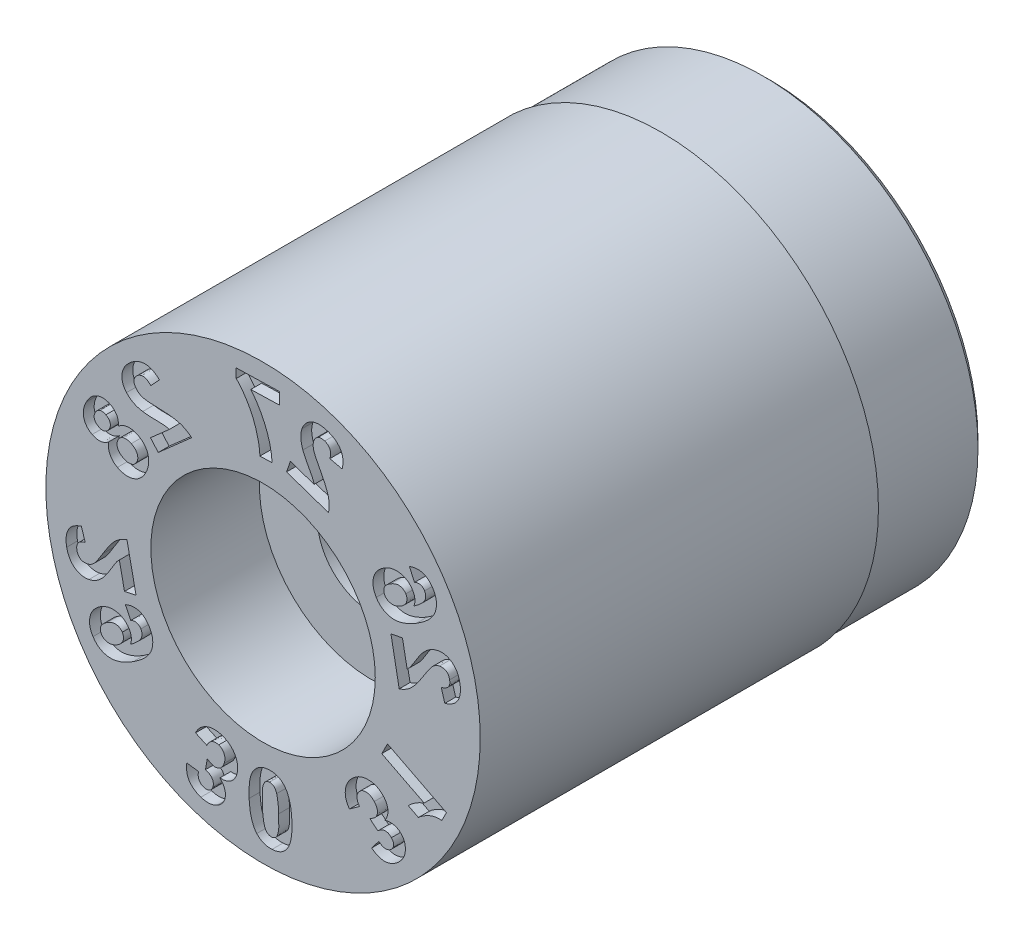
from build123d import *

# Parameters (mm, degrees)
SKETCH4_W          = 3
SKETCH4_H          = 1
CUT_EXTRUDE1_DEPTH = 0.3


with BuildPart() as part:
    # Sketch1 → Revolve1 (revolve)
    with BuildSketch(Plane(origin=(0, 0, 0), x_dir=(0, 0, -1), z_dir=(1, 0, 0)), mode=Mode.PRIVATE) as revolve1_sk:
        Polygon((0, 6), (0, 3.1), (3, 3.1), (3, 1.5), (14, 1.5), (14, 5.75), (13.75, 6), align=None)
    revolve(revolve1_sk.sketch.rotate(Axis((0, 0, 3.797909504), (0, 0, -1)), 90), axis=Axis((0, 0, 3.797909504), (0, 0, -1)))

    # Sketch4 → Cut-Revolve1 (revolve, cut)
    with BuildSketch(Plane(origin=(0, 0, 0), x_dir=(0, 0, -1), z_dir=(1, 0, 0)), mode=Mode.PRIVATE) as cut_revolve1_sk:
        with Locations((12.5, 6.435)):
            Rectangle(SKETCH4_W, SKETCH4_H)
    revolve(cut_revolve1_sk.sketch.rotate(Axis((0, 0, 0), (0, 0, -1)), 90), axis=Axis((0, 0, 0), (0, 0, -1)), mode=Mode.SUBTRACT)

    # Sketch5 → Cut-Extrude1 (cut)
    # profile 1 of 12: a face of its own
    with BuildSketch(Plane.XY):
        with BuildLine():
            Line((3.851545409, 1.325215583), (3.53271147, 1.264786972))
            Line((3.53271147, 1.264786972), (3.761229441, 0.062286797))
            add(Edge.make_bspline(
                [(3.761229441, 0.062286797), (3.790221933, 0.072159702), (3.848185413, 0.091898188), (3.930929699, 0.13313535), (4.009021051, 0.184055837), (4.07128676, 0.233844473), (4.119888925, 0.281100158), (4.159188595, 0.322999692), (4.200101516, 0.371919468), (4.243378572, 0.42716057), (4.289301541, 0.488597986), (4.336818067, 0.557197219), (4.386825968, 0.632065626), (4.420099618, 0.684726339), (4.437296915, 0.711943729)],
                knots=[0, 0, 0, 0, 1.147220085, 2.293589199, 3.454339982, 4.637223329, 5.275329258, 5.994362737, 6.789850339, 7.665130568, 8.624998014, 9.664856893, 10.793094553, 12, 12, 12, 12], degree=3))
            add(Edge.make_bspline(
                [(4.437296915, 0.711943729), (4.451053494, 0.733629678), (4.47726548, 0.774950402), (4.515248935, 0.833582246), (4.550087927, 0.885696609), (4.581806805, 0.931334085), (4.609434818, 0.97113946), (4.634828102, 1.003806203), (4.655883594, 1.030844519), (4.669968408, 1.045694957), (4.676173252, 1.052237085)],
                knots=[0, 0, 0, 0, 1.480685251, 2.821319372, 4.027849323, 5.09469801, 6.026007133, 6.820540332, 7.480407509, 8, 8, 8, 8], degree=3))
            add(Edge.make_bspline(
                [(4.676173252, 1.052237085), (4.691388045, 1.066417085), (4.720771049, 1.093801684), (4.770166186, 1.12535167), (4.819966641, 1.150257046), (4.855123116, 1.158579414), (4.872368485, 1.1626618)],
                knots=[0, 0, 0, 0, 1.090931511, 2.106820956, 3.071335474, 4, 4, 4, 4], degree=3))
            add(Edge.make_bspline(
                [(4.872368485, 1.1626618), (4.890603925, 1.165497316), (4.925280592, 1.170889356), (4.975835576, 1.168345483), (5.021358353, 1.156810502), (5.061405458, 1.135922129), (5.095348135, 1.106642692), (5.122681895, 1.069704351), (5.143190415, 1.02549051), (5.150676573, 0.992830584), (5.154580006, 0.975801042)],
                knots=[0, 0, 0, 0, 1.150072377, 2.186987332, 3.13691429, 4.061498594, 4.981295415, 5.911940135, 6.911243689, 8, 8, 8, 8], degree=3))
            add(Edge.make_bspline(
                [(5.154580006, 0.975801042), (5.157114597, 0.95863357), (5.161981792, 0.925666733), (5.158594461, 0.876845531), (5.145494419, 0.832149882), (5.127251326, 0.798288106), (5.107941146, 0.773726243), (5.090014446, 0.756506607), (5.069241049, 0.740441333), (5.045509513, 0.725560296), (5.018714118, 0.712129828), (4.989284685, 0.69917098), (4.956585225, 0.688099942), (4.933624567, 0.681887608), (4.921704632, 0.6786625)],
                knots=[0, 0, 0, 0, 1.462389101, 2.808237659, 4.094995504, 5.369015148, 6.02924103, 6.726811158, 7.462244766, 8.243668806, 9.088192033, 9.991417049, 10.957252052, 12, 12, 12, 12], degree=3))
            Line((4.921704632, 0.6786625), (5.02070932, 0.343313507))
            add(Edge.make_bspline(
                [(5.02070932, 0.343313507), (5.042968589, 0.350471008), (5.086183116, 0.364366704), (5.146914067, 0.390451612), (5.2022474, 0.419015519), (5.251736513, 0.451127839), (5.29558435, 0.486445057), (5.333330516, 0.525203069), (5.365491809, 0.566903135), (5.39138071, 0.611922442), (5.412378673, 0.659227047), (5.429262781, 0.708219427), (5.441434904, 0.759062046), (5.449951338, 0.811483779), (5.453393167, 0.865872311), (5.452837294, 0.921991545), (5.447388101, 0.979825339), (5.440966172, 1.018658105), (5.437697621, 1.038422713)],
                knots=[0, 0, 0, 0, 1.236899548, 2.40133801, 3.493579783, 4.529124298, 5.518326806, 6.467120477, 7.386052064, 8.298032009, 9.2085038, 10.121896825, 11.03658518, 11.9722747, 12.929255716, 13.917153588, 14.939899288, 16, 16, 16, 16], degree=3))
            add(Edge.make_bspline(
                [(5.437697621, 1.038422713), (5.433205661, 1.059842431), (5.42443768, 1.101652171), (5.406010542, 1.16146012), (5.383839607, 1.216842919), (5.358430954, 1.268173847), (5.328562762, 1.314839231), (5.29477013, 1.356936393), (5.257655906, 1.395141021), (5.216497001, 1.428149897), (5.17286481, 1.456389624), (5.128029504, 1.480219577), (5.081659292, 1.498247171), (5.034188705, 1.511513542), (4.985261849, 1.519914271), (4.935011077, 1.521935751), (4.883528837, 1.52011837), (4.849276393, 1.514406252), (4.831827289, 1.511496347)],
                knots=[0, 0, 0, 0, 1.215675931, 2.372911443, 3.472140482, 4.527892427, 5.550860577, 6.54423819, 7.523199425, 8.504681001, 9.468986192, 10.407992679, 11.321050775, 12.227730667, 13.14336324, 14.072288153, 15.01797241, 16, 16, 16, 16], degree=3))
            add(Edge.make_bspline(
                [(4.831827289, 1.511496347), (4.812054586, 1.507175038), (4.772679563, 1.498569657), (4.715742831, 1.47902357), (4.661025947, 1.454935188), (4.608710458, 1.425053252), (4.557808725, 1.389038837), (4.506925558, 1.347251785), (4.45603253, 1.298451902), (4.42359322, 1.262414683), (4.40678832, 1.243745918)],
                knots=[0, 0, 0, 0, 0.94710676, 1.88605221, 2.813236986, 3.743255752, 4.701947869, 5.729954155, 6.82402269, 8, 8, 8, 8], degree=3))
            add(Edge.make_bspline(
                [(4.40678832, 1.243745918), (4.400810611, 1.236702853), (4.388096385, 1.22172268), (4.36896055, 1.197023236), (4.348125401, 1.168959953), (4.325949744, 1.137137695), (4.301647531, 1.102019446), (4.276354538, 1.062916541), (4.249021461, 1.020650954), (4.22105945, 0.975935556), (4.19361328, 0.931656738), (4.167685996, 0.89045454), (4.144174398, 0.853625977), (4.123490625, 0.820791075), (4.104989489, 0.792433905), (4.088487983, 0.768708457), (4.075031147, 0.748874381), (4.053553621, 0.720697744), (4.02403901, 0.684553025), (3.994798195, 0.65689737), (3.980908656, 0.64376079)],
                knots=[0, 0, 0, 0, 0.676339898, 1.43853413, 2.287243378, 3.235403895, 4.278392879, 5.414137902, 6.645054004, 7.963955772, 9.275627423, 10.459589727, 11.528447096, 12.474941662, 13.301133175, 14.007271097, 14.591130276, 15.055552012, 16.601371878, 18, 18, 18, 18], degree=3))
            Line((3.980908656, 0.64376079), (3.851545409, 1.325215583))
        make_face()
    # profile 2 of 12: a face of its own
    with BuildSketch(Plane.XY):
        with BuildLine():
            Line((4.042634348, 3.129129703), (4.185121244, 2.821146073))
            add(Edge.make_bspline(
                [(4.185121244, 2.821146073), (4.200286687, 2.827625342), (4.229020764, 2.839901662), (4.272532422, 2.84972456), (4.312793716, 2.85314932), (4.349974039, 2.847249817), (4.383761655, 2.834277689), (4.413986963, 2.814342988), (4.441359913, 2.788435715), (4.455299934, 2.766953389), (4.462530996, 2.75580993)],
                knots=[0, 0, 0, 0, 1.243750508, 2.356543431, 3.356521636, 4.278455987, 5.175606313, 6.070832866, 6.999289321, 8, 8, 8, 8], degree=3))
            add(Edge.make_bspline(
                [(4.462530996, 2.75580993), (4.466995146, 2.747867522), (4.475729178, 2.732328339), (4.485016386, 2.707394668), (4.491321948, 2.682067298), (4.494669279, 2.655867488), (4.493977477, 2.628990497), (4.49112676, 2.601271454), (4.483851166, 2.573211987), (4.474399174, 2.543768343), (4.459465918, 2.512935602), (4.437592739, 2.48084562), (4.40921376, 2.447059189), (4.374212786, 2.411326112), (4.333174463, 2.37309996), (4.284926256, 2.333486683), (4.230581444, 2.291453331), (4.191364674, 2.263895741), (4.170861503, 2.249488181)],
                knots=[0, 0, 0, 0, 0.674786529, 1.320208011, 1.965629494, 2.607568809, 3.271753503, 3.955340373, 4.669106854, 5.416562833, 6.246137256, 7.198993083, 8.289073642, 9.514359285, 10.90623546, 12.446037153, 14.141929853, 16, 16, 16, 16], degree=3))
            add(Edge.make_bspline(
                [(4.170861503, 2.249488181), (4.175754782, 2.265193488), (4.185333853, 2.295938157), (4.19322732, 2.3428719), (4.196585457, 2.388765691), (4.194658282, 2.433972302), (4.187252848, 2.478330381), (4.175016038, 2.521937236), (4.15758809, 2.564696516), (4.142353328, 2.591724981), (4.134616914, 2.605450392)],
                knots=[0, 0, 0, 0, 1.065902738, 2.086608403, 3.078632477, 4.046352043, 5.013809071, 5.989078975, 6.978827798, 8, 8, 8, 8], degree=3))
            add(Edge.make_bspline(
                [(4.134616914, 2.605450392), (4.124896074, 2.620452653), (4.10573899, 2.650017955), (4.072370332, 2.690577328), (4.035391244, 2.72657667), (3.99494063, 2.758283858), (3.95107838, 2.785367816), (3.903674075, 2.80802086), (3.852854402, 2.826104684), (3.799294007, 2.840040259), (3.744029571, 2.849404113), (3.687981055, 2.852170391), (3.631869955, 2.849886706), (3.575727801, 2.841519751), (3.519522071, 2.827606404), (3.463626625, 2.807184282), (3.407105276, 2.782257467), (3.370800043, 2.761193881), (3.352217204, 2.750412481)],
                knots=[0, 0, 0, 0, 0.965376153, 1.90248899, 2.830883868, 3.748895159, 4.674080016, 5.610745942, 6.582492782, 7.584167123, 8.598173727, 9.605289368, 10.610740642, 11.627936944, 12.667187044, 13.733647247, 14.839966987, 16, 16, 16, 16], degree=3))
            add(Edge.make_bspline(
                [(3.352217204, 2.750412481), (3.333017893, 2.738348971), (3.295417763, 2.714723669), (3.244041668, 2.674375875), (3.19819092, 2.631737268), (3.15793989, 2.586343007), (3.12336157, 2.538388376), (3.093701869, 2.488094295), (3.070756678, 2.434721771), (3.052826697, 2.379511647), (3.041183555, 2.322930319), (3.035226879, 2.266202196), (3.035358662, 2.209666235), (3.041365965, 2.153436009), (3.053768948, 2.097427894), (3.072126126, 2.041820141), (3.09618789, 1.986186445), (3.11666436, 1.9507069), (3.12713012, 1.932572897)],
                knots=[0, 0, 0, 0, 1.140051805, 2.232689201, 3.280454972, 4.286346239, 5.279336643, 6.250700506, 7.217313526, 8.195867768, 9.166287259, 10.117783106, 11.060566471, 12.005131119, 12.957168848, 13.940629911, 14.947432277, 16, 16, 16, 16], degree=3))
            add(Edge.make_bspline(
                [(3.12713012, 1.932572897), (3.139289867, 1.913636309), (3.163159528, 1.876463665), (3.205398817, 1.826537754), (3.25147891, 1.782461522), (3.302084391, 1.744865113), (3.356515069, 1.712890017), (3.41516727, 1.687308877), (3.477991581, 1.668078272), (3.544943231, 1.65456054), (3.616427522, 1.648814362), (3.692207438, 1.652925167), (3.772376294, 1.665361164), (3.85676294, 1.687961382), (3.945569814, 1.719187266), (4.038662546, 1.759682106), (4.136507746, 1.808634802), (4.20159183, 1.84716234), (4.235301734, 1.867117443)],
                knots=[0, 0, 0, 0, 0.860632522, 1.68942714, 2.496262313, 3.296477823, 4.09684533, 4.907700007, 5.739717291, 6.607298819, 7.517513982, 8.476535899, 9.505544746, 10.617505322, 11.815317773, 13.105799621, 14.500966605, 16, 16, 16, 16], degree=3))
            add(Edge.make_bspline(
                [(4.235301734, 1.867117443), (4.269464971, 1.888378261), (4.335309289, 1.929355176), (4.426806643, 1.994580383), (4.50757995, 2.060474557), (4.578440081, 2.126352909), (4.638705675, 2.192912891), (4.688303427, 2.260200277), (4.728063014, 2.327774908), (4.756522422, 2.396239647), (4.776152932, 2.4642586), (4.788214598, 2.531690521), (4.792173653, 2.598596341), (4.789007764, 2.665038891), (4.777243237, 2.730638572), (4.758231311, 2.795718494), (4.731706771, 2.86019995), (4.708323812, 2.90123636), (4.696437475, 2.922096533)],
                knots=[0, 0, 0, 0, 1.481724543, 2.855793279, 4.135027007, 5.318513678, 6.416003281, 7.436741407, 8.392386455, 9.296143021, 10.159613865, 10.995357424, 11.813633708, 12.623053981, 13.439426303, 14.261895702, 15.116463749, 16, 16, 16, 16], degree=3))
            add(Edge.make_bspline(
                [(4.696437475, 2.922096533), (4.687433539, 2.936393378), (4.66978163, 2.964421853), (4.639666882, 3.002921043), (4.608173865, 3.037956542), (4.574407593, 3.069008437), (4.538863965, 3.096545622), (4.501066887, 3.119921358), (4.461534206, 3.139960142), (4.420055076, 3.155656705), (4.37705408, 3.168010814), (4.332589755, 3.175151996), (4.287079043, 3.17863177), (4.240416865, 3.177348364), (4.19250983, 3.171892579), (4.143320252, 3.162174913), (4.092913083, 3.148142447), (4.05964062, 3.135560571), (4.042634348, 3.129129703)],
                knots=[0, 0, 0, 0, 1.072816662, 2.103220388, 3.100906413, 4.062803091, 5.013741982, 5.953076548, 6.882105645, 7.825162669, 8.766700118, 9.719527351, 10.680948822, 11.662782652, 12.680333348, 13.740926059, 14.845338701, 16, 16, 16, 16], degree=3))
        make_face()
        with BuildLine():
            add(Edge.make_bspline(
                [(3.801180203, 2.060667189), (3.789270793, 2.053750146), (3.766116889, 2.040302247), (3.730900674, 2.02334171), (3.69658503, 2.009361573), (3.662869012, 1.999167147), (3.630070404, 1.991927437), (3.598043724, 1.988710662), (3.566836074, 1.988055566), (3.536660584, 1.991153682), (3.508052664, 1.997114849), (3.481175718, 2.004690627), (3.45643636, 2.014719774), (3.433853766, 2.026812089), (3.41361517, 2.041385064), (3.39504984, 2.057556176), (3.378778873, 2.076112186), (3.369784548, 2.089789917), (3.365281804, 2.096637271)],
                knots=[0, 0, 0, 0, 1.357717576, 2.639632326, 3.851313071, 5.007950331, 6.109392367, 7.15784644, 8.177048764, 9.182766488, 10.141402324, 11.056235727, 11.932715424, 12.768821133, 13.575891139, 14.386952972, 15.192475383, 16, 16, 16, 16], degree=3))
            add(Edge.make_bspline(
                [(3.365281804, 2.096637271), (3.357913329, 2.110382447), (3.343469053, 2.137326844), (3.334061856, 2.182300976), (3.334746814, 2.228240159), (3.343441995, 2.266930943), (3.356378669, 2.29761225), (3.369437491, 2.321260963), (3.386851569, 2.344123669), (3.407237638, 2.367326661), (3.43155275, 2.390124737), (3.459219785, 2.412941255), (3.490778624, 2.435353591), (3.513387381, 2.449506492), (3.525143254, 2.456865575)],
                knots=[0, 0, 0, 0, 1.258246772, 2.46651624, 3.672980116, 4.959920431, 5.649370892, 6.3663693, 7.14211584, 7.972643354, 8.866663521, 9.839149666, 10.876422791, 12, 12, 12, 12], degree=3))
            add(Edge.make_bspline(
                [(3.525143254, 2.456865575), (3.537497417, 2.464104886), (3.56139013, 2.478105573), (3.597404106, 2.495750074), (3.631732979, 2.510692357), (3.664893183, 2.521516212), (3.696608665, 2.529335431), (3.726746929, 2.534050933), (3.755628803, 2.535196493), (3.78298143, 2.532313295), (3.808857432, 2.527177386), (3.833147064, 2.519464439), (3.855865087, 2.509844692), (3.876743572, 2.497491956), (3.89618606, 2.483313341), (3.913616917, 2.4664239), (3.929904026, 2.447653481), (3.938914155, 2.433526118), (3.943502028, 2.426332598)],
                knots=[0, 0, 0, 0, 1.454020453, 2.812047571, 4.071281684, 5.253971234, 6.350553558, 7.386511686, 8.347835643, 9.277194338, 10.173795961, 11.023296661, 11.861816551, 12.67391376, 13.482358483, 14.300094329, 15.134424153, 16, 16, 16, 16], degree=3))
            add(Edge.make_bspline(
                [(3.943502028, 2.426332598), (3.951161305, 2.412037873), (3.966224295, 2.383925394), (3.976080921, 2.336800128), (3.976405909, 2.288342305), (3.966968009, 2.247802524), (3.955233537, 2.215218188), (3.942306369, 2.191114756), (3.926723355, 2.167446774), (3.907479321, 2.144865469), (3.885507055, 2.122676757), (3.860266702, 2.101231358), (3.83226712, 2.079975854), (3.811749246, 2.067231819), (3.801180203, 2.060667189)],
                knots=[0, 0, 0, 0, 1.318955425, 2.593901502, 3.88701297, 5.250700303, 5.969079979, 6.711869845, 7.47894987, 8.280270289, 9.131168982, 10.02773292, 10.984057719, 12, 12, 12, 12], degree=3))
        make_face(mode=Mode.SUBTRACT)
    # profile 3 of 12: a face of its own
    with BuildSketch(Plane.XY):
        with BuildLine():
            Line((0.755062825, 4.002481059), (0.650065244, 3.695797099))
            Line((0.650065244, 3.695797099), (1.806849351, 3.299291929))
            add(Edge.make_bspline(
                [(1.806849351, 3.299291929), (1.812700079, 3.329435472), (1.824395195, 3.389689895), (1.828723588, 3.481947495), (1.823648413, 3.574861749), (1.811052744, 3.653337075), (1.794252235, 3.718947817), (1.776988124, 3.773655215), (1.754998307, 3.833458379), (1.728960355, 3.898569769), (1.697886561, 3.968725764), (1.662039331, 4.04394404), (1.621586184, 4.124379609), (1.592488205, 4.179382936), (1.577395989, 4.20791145)],
                knots=[0, 0, 0, 0, 1.150610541, 2.299974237, 3.453286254, 4.637065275, 5.274132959, 5.992668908, 6.788027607, 7.663871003, 8.622817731, 9.665782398, 10.789313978, 12, 12, 12, 12], degree=3))
            add(Edge.make_bspline(
                [(1.577395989, 4.20791145), (1.565376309, 4.230541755), (1.542424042, 4.273755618), (1.510538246, 4.335802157), (1.482310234, 4.39173515), (1.458065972, 4.441726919), (1.43784739, 4.485788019), (1.42128465, 4.523643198), (1.408952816, 4.555495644), (1.402723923, 4.574911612), (1.399964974, 4.583511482)],
                knots=[0, 0, 0, 0, 1.478782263, 2.823819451, 4.025828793, 5.094456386, 6.03003214, 6.823413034, 7.478857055, 8, 8, 8, 8], degree=3))
            add(Edge.make_bspline(
                [(1.399964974, 4.583511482), (1.395490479, 4.603768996), (1.386845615, 4.642907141), (1.382519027, 4.701282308), (1.386658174, 4.756820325), (1.396615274, 4.791513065), (1.401512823, 4.80857721)],
                knots=[0, 0, 0, 0, 1.089945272, 2.105808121, 3.068313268, 4, 4, 4, 4], degree=3))
            add(Edge.make_bspline(
                [(1.401512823, 4.80857721), (1.408122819, 4.825669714), (1.420708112, 4.858213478), (1.447399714, 4.901127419), (1.479970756, 4.934993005), (1.517989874, 4.959343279), (1.560075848, 4.974514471), (1.605696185, 4.980068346), (1.654221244, 4.975877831), (1.686277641, 4.966371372), (1.702982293, 4.961417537)],
                knots=[0, 0, 0, 0, 1.144464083, 2.17903533, 3.137980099, 4.059139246, 4.977987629, 5.912607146, 6.912255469, 8, 8, 8, 8], degree=3))
            add(Edge.make_bspline(
                [(1.702982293, 4.961417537), (1.719196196, 4.955082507), (1.750352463, 4.942909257), (1.791153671, 4.915773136), (1.823375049, 4.882009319), (1.843829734, 4.849412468), (1.855647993, 4.820396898), (1.861718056, 4.7964248), (1.865115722, 4.770440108), (1.866212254, 4.742542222), (1.864896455, 4.712616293), (1.861213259, 4.680724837), (1.854957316, 4.646762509), (1.848986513, 4.623655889), (1.845889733, 4.611671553)],
                knots=[0, 0, 0, 0, 1.466360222, 2.817724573, 4.096595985, 5.379539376, 6.039418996, 6.734305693, 7.460299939, 8.247691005, 9.087940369, 9.986093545, 10.955479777, 12, 12, 12, 12], degree=3))
            Line((1.845889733, 4.611671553), (2.185873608, 4.532154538))
            add(Edge.make_bspline(
                [(2.185873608, 4.532154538), (2.19067236, 4.555071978), (2.199967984, 4.599465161), (2.207882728, 4.665106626), (2.209756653, 4.727330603), (2.206715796, 4.786146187), (2.197125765, 4.841445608), (2.183119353, 4.893473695), (2.162527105, 4.941934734), (2.136548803, 4.986761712), (2.105695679, 5.028245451), (2.071430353, 5.066975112), (2.033481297, 5.102963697), (1.991955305, 5.136146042), (1.946472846, 5.166269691), (1.897098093, 5.192895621), (1.844607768, 5.217729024), (1.807566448, 5.231036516), (1.788683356, 5.23782047)],
                knots=[0, 0, 0, 0, 1.239829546, 2.401663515, 3.496382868, 4.534061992, 5.515097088, 6.463938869, 7.381742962, 8.295361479, 9.201789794, 10.115663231, 11.031295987, 11.968506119, 12.927823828, 13.916406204, 14.937816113, 16, 16, 16, 16], degree=3))
            add(Edge.make_bspline(
                [(1.788683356, 5.23782047), (1.767921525, 5.244546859), (1.727386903, 5.257679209), (1.666314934, 5.271252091), (1.607108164, 5.279376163), (1.549882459, 5.282332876), (1.494581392, 5.279716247), (1.441331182, 5.271330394), (1.389814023, 5.257971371), (1.340952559, 5.238321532), (1.294710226, 5.214956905), (1.252299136, 5.187204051), (1.213159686, 5.156626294), (1.17818358, 5.121752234), (1.147296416, 5.082986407), (1.120213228, 5.04071805), (1.096752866, 4.9949466), (1.084593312, 4.962459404), (1.078401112, 4.94591544)],
                knots=[0, 0, 0, 0, 1.2134108, 2.369017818, 3.474387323, 4.534221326, 5.551972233, 6.547874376, 7.527916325, 8.505405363, 9.471504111, 10.405201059, 11.320151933, 12.229701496, 13.145570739, 14.071809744, 15.01807745, 16, 16, 16, 16], degree=3))
            add(Edge.make_bspline(
                [(1.078401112, 4.94591544), (1.072197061, 4.926560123), (1.059882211, 4.888140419), (1.049091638, 4.828893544), (1.043201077, 4.769473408), (1.043155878, 4.709203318), (1.049029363, 4.647080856), (1.060673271, 4.582286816), (1.077221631, 4.514008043), (1.092521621, 4.468212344), (1.100418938, 4.444574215)],
                knots=[0, 0, 0, 0, 0.951916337, 1.889524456, 2.816296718, 3.748298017, 4.709991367, 5.737457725, 6.8321553, 8, 8, 8, 8], degree=3))
            add(Edge.make_bspline(
                [(1.100418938, 4.444574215), (1.103653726, 4.435952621), (1.110523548, 4.417642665), (1.122378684, 4.388706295), (1.136740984, 4.356759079), (1.153270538, 4.321535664), (1.172107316, 4.283217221), (1.192978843, 4.241594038), (1.216987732, 4.197314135), (1.241679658, 4.150707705), (1.266331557, 4.104884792), (1.289555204, 4.062231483), (1.309823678, 4.023555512), (1.327793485, 3.989155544), (1.34339906, 3.959101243), (1.355593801, 3.932952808), (1.36626483, 3.911431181), (1.380363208, 3.878923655), (1.396849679, 3.835341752), (1.405913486, 3.796314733), (1.410214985, 3.777793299)],
                knots=[0, 0, 0, 0, 0.674642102, 1.432759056, 2.290563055, 3.240651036, 4.283325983, 5.418816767, 6.651777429, 7.973393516, 9.283123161, 10.463984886, 11.531541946, 12.482141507, 13.307645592, 14.012134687, 14.595854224, 15.067130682, 16.60811955, 18, 18, 18, 18], degree=3))
            Line((1.410214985, 3.777793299), (0.755062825, 4.002481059))
        make_face()
    # profile 4 of 12: a face of its own
    with BuildSketch(Plane.XY):
        with BuildLine():
            Line((0.456045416, 5.195615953), (0.447665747, 5.520366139))
            Line((0.447665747, 5.520366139), (-0.747713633, 5.4887745))
            Line((-0.747713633, 5.4887745), (-0.740977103, 5.235177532))
            add(Edge.make_bspline(
                [(-0.740977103, 5.235177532), (-0.728109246, 5.222833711), (-0.70163817, 5.197440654), (-0.66347413, 5.155764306), (-0.624702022, 5.110556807), (-0.585917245, 5.061248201), (-0.546844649, 5.007957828), (-0.507659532, 4.950481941), (-0.46779606, 4.889391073), (-0.414937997, 4.80249123), (-0.351520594, 4.689704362), (-0.285550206, 4.548200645), (-0.227438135, 4.402579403), (-0.187081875, 4.278084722), (-0.159841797, 4.177906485), (-0.141146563, 4.104804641), (-0.126037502, 4.033533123), (-0.113009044, 3.964339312), (-0.102060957, 3.897141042), (-0.094738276, 3.831757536), (-0.089084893, 3.768415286), (-0.087710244, 3.726768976), (-0.087033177, 3.706256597)],
                knots=[0, 0, 0, 0, 0.629792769, 1.295576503, 1.99530104, 2.73350668, 3.511221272, 4.329323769, 5.190726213, 6.087942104, 7.922417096, 9.758534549, 11.599181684, 13.458500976, 14.377972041, 15.266685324, 16.12371333, 16.951215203, 17.754115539, 18.528200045, 19.275082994, 20, 20, 20, 20], degree=3))
            Line((-0.087033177, 3.706256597), (0.249862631, 3.715294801))
            add(Edge.make_bspline(
                [(0.249862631, 3.715294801), (0.248021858, 3.746830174), (0.24432222, 3.810210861), (0.232174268, 3.905192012), (0.217572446, 4.000800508), (0.197120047, 4.096515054), (0.173472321, 4.19277761), (0.144074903, 4.288989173), (0.111863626, 4.386077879), (0.074402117, 4.482664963), (0.033736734, 4.578307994), (-0.010701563, 4.671545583), (-0.057377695, 4.762450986), (-0.10792356, 4.850224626), (-0.160563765, 4.935700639), (-0.21712367, 5.017908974), (-0.275748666, 5.098081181), (-0.317710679, 5.149164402), (-0.338665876, 5.174674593)],
                knots=[0, 0, 0, 0, 0.947460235, 1.90423243, 2.871456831, 3.84842382, 4.839564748, 5.844483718, 6.865792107, 7.907941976, 8.95162272, 9.983203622, 11.006107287, 12.0166422, 13.021297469, 14.01697948, 15.009709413, 16, 16, 16, 16], degree=3))
            Line((-0.338665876, 5.174674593), (0.456045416, 5.195615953))
        make_face()
    # profile 5 of 12: a face of its own
    with BuildSketch(Plane.XY):
        with BuildLine():
            Line((-3.109843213, 2.633413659), (-2.894509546, 2.389518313))
            Line((-2.894509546, 2.389518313), (-1.974776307, 3.201678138))
            add(Edge.make_bspline(
                [(-1.974776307, 3.201678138), (-1.998191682, 3.221653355), (-2.044998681, 3.261583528), (-2.123064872, 3.311471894), (-2.206605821, 3.353295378), (-2.281529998, 3.381061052), (-2.347121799, 3.398865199), (-2.403409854, 3.41088355), (-2.466403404, 3.421494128), (-2.536222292, 3.430882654), (-2.612833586, 3.438272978), (-2.696147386, 3.44443093), (-2.786192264, 3.449247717), (-2.848527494, 3.451225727), (-2.880825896, 3.452250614)],
                knots=[0, 0, 0, 0, 1.149872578, 2.298578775, 3.453872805, 4.638550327, 5.279229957, 5.994292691, 6.790008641, 7.667626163, 8.628173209, 9.667783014, 10.791584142, 12, 12, 12, 12], degree=3))
            add(Edge.make_bspline(
                [(-2.880825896, 3.452250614), (-2.906597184, 3.453065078), (-2.955660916, 3.454615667), (-3.025645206, 3.45714019), (-3.088381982, 3.460559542), (-3.144035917, 3.463913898), (-3.192448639, 3.467981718), (-3.233615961, 3.4725972), (-3.267454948, 3.477659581), (-3.287421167, 3.482014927), (-3.296215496, 3.483933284)],
                knots=[0, 0, 0, 0, 1.483617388, 2.824531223, 4.02933581, 5.098724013, 6.032566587, 6.824381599, 7.482186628, 8, 8, 8, 8], degree=3))
            add(Edge.make_bspline(
                [(-3.296215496, 3.483933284), (-3.316297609, 3.489908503), (-3.355070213, 3.501444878), (-3.407941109, 3.527442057), (-3.454871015, 3.55798425), (-3.480047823, 3.58409967), (-3.492449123, 3.5969633)],
                knots=[0, 0, 0, 0, 1.092898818, 2.110063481, 3.069077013, 4, 4, 4, 4], degree=3))
            add(Edge.make_bspline(
                [(-3.492449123, 3.5969633), (-3.504180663, 3.611213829), (-3.526483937, 3.638306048), (-3.550065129, 3.683102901), (-3.563683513, 3.728131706), (-3.565911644, 3.773258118), (-3.558058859, 3.817400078), (-3.540715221, 3.85996056), (-3.512591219, 3.899976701), (-3.488478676, 3.923273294), (-3.475843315, 3.935481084)],
                knots=[0, 0, 0, 0, 1.148921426, 2.184258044, 3.135231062, 4.06132771, 4.974490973, 5.91149549, 6.905590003, 8, 8, 8, 8], degree=3))
            add(Edge.make_bspline(
                [(-3.475843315, 3.935481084), (-3.462305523, 3.946446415), (-3.436265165, 3.967538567), (-3.392277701, 3.989287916), (-3.347133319, 4.001391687), (-3.308510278, 4.003066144), (-3.277516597, 3.998685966), (-3.253466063, 3.992334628), (-3.229096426, 3.982462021), (-3.204171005, 3.969530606), (-3.178549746, 3.953800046), (-3.152772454, 3.934309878), (-3.126128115, 3.912214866), (-3.108907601, 3.895680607), (-3.100023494, 3.88715054)],
                knots=[0, 0, 0, 0, 1.46313506, 2.814385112, 4.095562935, 5.374358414, 6.036446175, 6.725458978, 7.463071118, 8.24517902, 9.087552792, 9.990791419, 10.9634442, 12, 12, 12, 12], degree=3))
            Line((-3.100023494, 3.88715054), (-2.861485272, 4.143257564))
            add(Edge.make_bspline(
                [(-2.861485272, 4.143257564), (-2.879174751, 4.158862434), (-2.913372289, 4.189029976), (-2.966780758, 4.228588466), (-3.019978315, 4.261380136), (-3.073119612, 4.28744882), (-3.125915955, 4.307121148), (-3.1784109, 4.320713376), (-3.230854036, 4.326675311), (-3.282823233, 4.32629282), (-3.33426732, 4.320222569), (-3.384964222, 4.309251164), (-3.435165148, 4.294264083), (-3.484596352, 4.274192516), (-3.533207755, 4.249270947), (-3.581352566, 4.220090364), (-3.628693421, 4.186138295), (-3.65890819, 4.160598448), (-3.674310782, 4.147578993)],
                knots=[0, 0, 0, 0, 1.24423091, 2.405363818, 3.502016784, 4.537343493, 5.523266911, 6.470492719, 7.391077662, 8.299715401, 9.206964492, 10.119294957, 11.033581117, 11.968008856, 12.929961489, 13.913067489, 14.936143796, 16, 16, 16, 16], degree=3))
            add(Edge.make_bspline(
                [(-3.674310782, 4.147578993), (-3.690569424, 4.132750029), (-3.722223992, 4.103878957), (-3.763923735, 4.056994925), (-3.800531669, 4.009763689), (-3.831742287, 3.961605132), (-3.856421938, 3.911874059), (-3.875927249, 3.86134838), (-3.889428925, 3.809691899), (-3.896845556, 3.757444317), (-3.899197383, 3.705632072), (-3.896682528, 3.654734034), (-3.888551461, 3.605340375), (-3.875569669, 3.557476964), (-3.857164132, 3.511345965), (-3.83382378, 3.466773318), (-3.805969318, 3.423168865), (-3.783323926, 3.396559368), (-3.771823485, 3.38304576)],
                knots=[0, 0, 0, 0, 1.218879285, 2.373082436, 3.472029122, 4.528904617, 5.547623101, 6.543509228, 7.525823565, 8.499794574, 9.462849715, 10.396544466, 11.318821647, 12.231826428, 13.139942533, 14.065456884, 15.017544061, 16, 16, 16, 16], degree=3))
            add(Edge.make_bspline(
                [(-3.771823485, 3.38304576), (-3.758083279, 3.368128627), (-3.73075628, 3.338460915), (-3.684716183, 3.299638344), (-3.63596558, 3.264937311), (-3.583269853, 3.23534094), (-3.526238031, 3.209700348), (-3.464170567, 3.187045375), (-3.396129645, 3.168477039), (-3.348576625, 3.158835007), (-3.324033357, 3.15385852)],
                knots=[0, 0, 0, 0, 0.947566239, 1.884552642, 2.809911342, 3.742448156, 4.705563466, 5.7313501, 6.829094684, 8, 8, 8, 8], degree=3))
            add(Edge.make_bspline(
                [(-3.324033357, 3.15385852), (-3.314945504, 3.152280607), (-3.295566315, 3.148915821), (-3.264421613, 3.145319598), (-3.229456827, 3.141732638), (-3.190613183, 3.138366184), (-3.147850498, 3.135716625), (-3.101306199, 3.13382641), (-3.050882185, 3.131920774), (-2.998049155, 3.130992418), (-2.945697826, 3.129986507), (-2.896945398, 3.128766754), (-2.85315898, 3.127478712), (-2.814340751, 3.126035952), (-2.780366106, 3.124467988), (-2.751361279, 3.122744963), (-2.727311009, 3.120982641), (-2.692097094, 3.117282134), (-2.645977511, 3.110161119), (-2.607435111, 3.098826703), (-2.5890829, 3.093429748)],
                knots=[0, 0, 0, 0, 0.673662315, 1.436536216, 2.289348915, 3.241374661, 4.284367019, 5.418771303, 6.644111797, 7.970285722, 9.27860367, 10.469033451, 11.532673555, 12.478502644, 13.306588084, 14.017030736, 14.601025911, 15.067811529, 16.603819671, 18, 18, 18, 18], degree=3))
            Line((-2.5890829, 3.093429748), (-3.109843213, 2.633413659))
        make_face()
    # profile 6 of 12: a face of its own
    with BuildSketch(Plane.XY):
        with BuildLine():
            add(Edge.make_bspline(
                [(-3.997924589, 2.465609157), (-3.996507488, 2.4890315), (-3.993773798, 2.534214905), (-4.00137142, 2.599642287), (-4.016589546, 2.659956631), (-4.042524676, 2.71369549), (-4.075251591, 2.761720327), (-4.11399415, 2.803955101), (-4.158347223, 2.840955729), (-4.19160645, 2.86044284), (-4.208474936, 2.870326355)],
                knots=[0, 0, 0, 0, 1.156636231, 2.231235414, 3.238509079, 4.214077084, 5.160536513, 6.099205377, 7.035950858, 8, 8, 8, 8], degree=3))
            add(Edge.make_bspline(
                [(-4.208474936, 2.870326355), (-4.223329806, 2.877721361), (-4.252604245, 2.892294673), (-4.297969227, 2.908787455), (-4.343360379, 2.920559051), (-4.388916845, 2.926956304), (-4.434647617, 2.929006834), (-4.480598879, 2.925133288), (-4.526640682, 2.917081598), (-4.572366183, 2.90349527), (-4.61745127, 2.885496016), (-4.660838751, 2.861548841), (-4.702276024, 2.832357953), (-4.741524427, 2.797659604), (-4.779185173, 2.758108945), (-4.814754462, 2.713147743), (-4.84830397, 2.662903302), (-4.868454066, 2.626878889), (-4.878810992, 2.60836274)],
                knots=[0, 0, 0, 0, 0.980829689, 1.93291766, 2.849020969, 3.74945479, 4.649184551, 5.550556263, 6.471403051, 7.409099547, 8.366855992, 9.337293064, 10.333110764, 11.358865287, 12.430840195, 13.559286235, 14.745500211, 16, 16, 16, 16], degree=3))
            add(Edge.make_bspline(
                [(-4.878810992, 2.60836274), (-4.888389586, 2.589698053), (-4.907058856, 2.553319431), (-4.929249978, 2.497748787), (-4.946439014, 2.443596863), (-4.958411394, 2.390631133), (-4.964462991, 2.33874015), (-4.965929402, 2.288110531), (-4.961389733, 2.238770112), (-4.951479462, 2.191102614), (-4.937229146, 2.145366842), (-4.918623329, 2.102185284), (-4.895474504, 2.062210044), (-4.869337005, 2.024493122), (-4.83800551, 1.990522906), (-4.803231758, 1.959060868), (-4.764076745, 1.930815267), (-4.735751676, 1.914699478), (-4.721319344, 1.90648808)],
                knots=[0, 0, 0, 0, 1.24225853, 2.421238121, 3.53978031, 4.605471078, 5.632582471, 6.630178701, 7.60085882, 8.560533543, 9.50938233, 10.434483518, 11.339406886, 12.242220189, 13.14702646, 14.070293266, 15.016766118, 16, 16, 16, 16], degree=3))
            add(Edge.make_bspline(
                [(-4.721319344, 1.90648808), (-4.702736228, 1.897555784), (-4.666363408, 1.88007256), (-4.608522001, 1.863415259), (-4.549983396, 1.855858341), (-4.49107366, 1.857566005), (-4.432942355, 1.867508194), (-4.376525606, 1.886801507), (-4.321944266, 1.914202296), (-4.288649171, 1.938548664), (-4.271664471, 1.950968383)],
                knots=[0, 0, 0, 0, 1.030640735, 2.017277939, 2.997897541, 3.973800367, 4.956654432, 5.938334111, 6.948290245, 8, 8, 8, 8], degree=3))
            add(Edge.make_bspline(
                [(-4.271664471, 1.950968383), (-4.272857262, 1.937719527), (-4.275214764, 1.911533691), (-4.275546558, 1.872762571), (-4.273742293, 1.835146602), (-4.268942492, 1.798731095), (-4.261085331, 1.763617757), (-4.251428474, 1.729445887), (-4.238543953, 1.696719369), (-4.218665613, 1.654517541), (-4.187289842, 1.6052957), (-4.140824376, 1.552477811), (-4.086133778, 1.505625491), (-4.044056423, 1.481428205), (-4.022615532, 1.469098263)],
                knots=[0, 0, 0, 0, 0.827113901, 1.634757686, 2.409328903, 3.168055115, 3.915927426, 4.645817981, 5.374427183, 6.100708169, 7.54557039, 8.986364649, 10.464375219, 12, 12, 12, 12], degree=3))
            add(Edge.make_bspline(
                [(-4.022615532, 1.469098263), (-4.004215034, 1.459948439), (-3.968199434, 1.442039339), (-3.912843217, 1.420473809), (-3.857497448, 1.405815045), (-3.80247556, 1.396356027), (-3.747775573, 1.393282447), (-3.693116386, 1.395069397), (-3.638879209, 1.403933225), (-3.58515458, 1.417622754), (-3.533048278, 1.437117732), (-3.483377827, 1.46200125), (-3.436494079, 1.49215429), (-3.392506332, 1.527645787), (-3.351107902, 1.568235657), (-3.313296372, 1.614679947), (-3.277391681, 1.665657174), (-3.256649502, 1.702666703), (-3.246031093, 1.721612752)],
                knots=[0, 0, 0, 0, 1.072492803, 2.099207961, 3.094758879, 4.056620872, 5.008465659, 5.950099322, 6.905610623, 7.8711863, 8.840376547, 9.803776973, 10.766045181, 11.744507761, 12.749599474, 13.786600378, 14.866908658, 16, 16, 16, 16], degree=3))
            add(Edge.make_bspline(
                [(-3.246031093, 1.721612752), (-3.236765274, 1.739632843), (-3.218597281, 1.774965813), (-3.196861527, 1.829468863), (-3.179829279, 1.883400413), (-3.167437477, 1.936997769), (-3.159298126, 1.990126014), (-3.157232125, 2.043073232), (-3.159125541, 2.095545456), (-3.164333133, 2.130024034), (-3.166936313, 2.147259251)],
                knots=[0, 0, 0, 0, 1.101519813, 2.159809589, 3.186706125, 4.174800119, 5.149311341, 6.104898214, 7.052672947, 8, 8, 8, 8], degree=3))
            add(Edge.make_bspline(
                [(-3.166936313, 2.147259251), (-3.171188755, 2.167159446), (-3.179548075, 2.206278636), (-3.199721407, 2.262381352), (-3.226470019, 2.314370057), (-3.258376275, 2.363171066), (-3.297199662, 2.407500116), (-3.341191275, 2.448794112), (-3.391750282, 2.485976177), (-3.428758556, 2.506954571), (-3.447702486, 2.517693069)],
                knots=[0, 0, 0, 0, 1.012278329, 1.989905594, 2.95722232, 3.917551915, 4.884868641, 5.883397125, 6.916545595, 8, 8, 8, 8], degree=3))
            add(Edge.make_bspline(
                [(-3.447702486, 2.517693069), (-3.469502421, 2.528204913), (-3.512485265, 2.548931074), (-3.580944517, 2.569365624), (-3.650759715, 2.58042618), (-3.709863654, 2.581774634), (-3.757202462, 2.577388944), (-3.792602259, 2.570633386), (-3.828042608, 2.56161369), (-3.862528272, 2.547976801), (-3.897398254, 2.532752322), (-3.931181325, 2.51307326), (-3.96511002, 2.490952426), (-3.986819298, 2.474185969), (-3.997924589, 2.465609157)],
                knots=[0, 0, 0, 0, 1.478950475, 2.916040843, 4.352246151, 5.79334197, 6.519894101, 7.257255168, 7.99660621, 8.753333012, 9.523274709, 10.322389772, 11.14182545, 12, 12, 12, 12], degree=3))
        make_face()
        with BuildLine():
            add(Edge.make_bspline(
                [(-4.341353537, 2.567067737), (-4.327130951, 2.558832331), (-4.299954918, 2.543096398), (-4.266284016, 2.512251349), (-4.240334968, 2.478062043), (-4.224318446, 2.439549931), (-4.216715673, 2.398941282), (-4.218007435, 2.356913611), (-4.228485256, 2.314093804), (-4.241330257, 2.286931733), (-4.248030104, 2.272764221)],
                knots=[0, 0, 0, 0, 1.127003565, 2.153439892, 3.11735205, 4.055034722, 4.993402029, 5.938059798, 6.924508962, 8, 8, 8, 8], degree=3))
            add(Edge.make_bspline(
                [(-4.248030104, 2.272764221), (-4.255971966, 2.259192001), (-4.271264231, 2.233058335), (-4.301676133, 2.200677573), (-4.335785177, 2.175385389), (-4.37442836, 2.159209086), (-4.415580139, 2.151125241), (-4.458756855, 2.152312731), (-4.503188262, 2.16348883), (-4.531569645, 2.177100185), (-4.546439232, 2.184231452)],
                knots=[0, 0, 0, 0, 1.070826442, 2.061904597, 3.010560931, 3.950121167, 4.897552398, 5.854335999, 6.875842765, 8, 8, 8, 8], degree=3))
            add(Edge.make_bspline(
                [(-4.546439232, 2.184231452), (-4.559961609, 2.19204465), (-4.585961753, 2.207067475), (-4.617856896, 2.237489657), (-4.642559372, 2.271650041), (-4.658677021, 2.309850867), (-4.666709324, 2.350401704), (-4.665602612, 2.392108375), (-4.655988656, 2.434716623), (-4.643104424, 2.461498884), (-4.636378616, 2.475479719)],
                knots=[0, 0, 0, 0, 1.089019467, 2.093911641, 3.05680281, 4.019233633, 4.970549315, 5.926666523, 6.917681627, 8, 8, 8, 8], degree=3))
            add(Edge.make_bspline(
                [(-4.636378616, 2.475479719), (-4.628322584, 2.48930657), (-4.612878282, 2.515814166), (-4.582097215, 2.548406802), (-4.547802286, 2.573813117), (-4.509205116, 2.590166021), (-4.46815538, 2.597965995), (-4.425843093, 2.596876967), (-4.382737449, 2.58672376), (-4.355513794, 2.573793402), (-4.341353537, 2.567067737)],
                knots=[0, 0, 0, 0, 1.100051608, 2.108920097, 3.066709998, 4.023637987, 4.972395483, 5.926582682, 6.921521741, 8, 8, 8, 8], degree=3))
        make_face(mode=Mode.SUBTRACT)
        with BuildLine():
            add(Edge.make_bspline(
                [(-3.638699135, 2.229569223), (-3.628505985, 2.22392241), (-3.608669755, 2.212933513), (-3.581028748, 2.194396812), (-3.556190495, 2.174698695), (-3.534148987, 2.15385515), (-3.51478282, 2.132079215), (-3.498950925, 2.108773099), (-3.485288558, 2.084751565), (-3.47473982, 2.059713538), (-3.466802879, 2.034165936), (-3.46226135, 2.008451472), (-3.459445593, 1.982878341), (-3.460440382, 1.95749865), (-3.463581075, 1.932400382), (-3.469962, 1.907663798), (-3.478714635, 1.882940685), (-3.486536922, 1.867005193), (-3.490523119, 1.858884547)],
                knots=[0, 0, 0, 0, 1.245570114, 2.423923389, 3.554053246, 4.631327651, 5.66443923, 6.662975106, 7.63833994, 8.614854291, 9.562394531, 10.492191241, 11.403331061, 12.307434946, 13.20097763, 14.103266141, 15.033434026, 16, 16, 16, 16], degree=3))
            add(Edge.make_bspline(
                [(-3.490523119, 1.858884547), (-3.499380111, 1.843900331), (-3.51660519, 1.814759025), (-3.552869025, 1.779396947), (-3.595096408, 1.752839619), (-3.634938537, 1.738467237), (-3.668867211, 1.731979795), (-3.695727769, 1.729613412), (-3.723444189, 1.730647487), (-3.751904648, 1.734773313), (-3.781252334, 1.741552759), (-3.811245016, 1.751726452), (-3.842590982, 1.763996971), (-3.863051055, 1.774604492), (-3.873611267, 1.780079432)],
                knots=[0, 0, 0, 0, 1.416510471, 2.754829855, 4.090098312, 5.465233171, 6.184685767, 6.907907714, 7.662676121, 8.444382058, 9.253808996, 10.118981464, 11.029135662, 12, 12, 12, 12], degree=3))
            add(Edge.make_bspline(
                [(-3.873611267, 1.780079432), (-3.891187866, 1.790308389), (-3.925022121, 1.809998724), (-3.967752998, 1.848029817), (-4.000798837, 1.891224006), (-4.019335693, 1.931398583), (-4.029160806, 1.964584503), (-4.034035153, 1.989590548), (-4.035609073, 2.014567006), (-4.034842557, 2.039410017), (-4.031277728, 2.064093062), (-4.025076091, 2.088869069), (-4.016027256, 2.113542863), (-4.008005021, 2.129416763), (-4.003953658, 2.137433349)],
                knots=[0, 0, 0, 0, 1.710395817, 3.292443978, 4.785673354, 6.263205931, 6.990178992, 7.699840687, 8.404880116, 9.094547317, 9.7910201, 10.50211538, 11.24354318, 12, 12, 12, 12], degree=3))
            add(Edge.make_bspline(
                [(-4.003953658, 2.137433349), (-3.998839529, 2.146419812), (-3.988935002, 2.163823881), (-3.97164089, 2.187478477), (-3.953157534, 2.208208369), (-3.93257319, 2.225368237), (-3.911053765, 2.240212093), (-3.887477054, 2.251308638), (-3.862704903, 2.259592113), (-3.82814062, 2.265918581), (-3.784690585, 2.268093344), (-3.733609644, 2.263628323), (-3.684304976, 2.251335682), (-3.653986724, 2.236865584), (-3.638699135, 2.229569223)],
                knots=[0, 0, 0, 0, 0.880321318, 1.704916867, 2.491980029, 3.239922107, 3.983161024, 4.713009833, 5.452108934, 6.202610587, 7.699885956, 9.143504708, 10.559648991, 12, 12, 12, 12], degree=3))
        make_face(mode=Mode.SUBTRACT)
    # profile 7 of 12: a face of its own
    with BuildSketch(Plane.XY):
        with BuildLine():
            Line((-3.827253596, -1.401108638), (-3.508368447, -1.334657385))
            Line((-3.508368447, -1.334657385), (-3.759302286, -0.13185626))
            add(Edge.make_bspline(
                [(-3.759302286, -0.13185626), (-3.788302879, -0.142189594), (-3.846235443, -0.162831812), (-3.927870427, -0.20689687), (-4.006130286, -0.258295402), (-4.067302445, -0.310064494), (-4.115877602, -0.357782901), (-4.154030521, -0.400942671), (-4.194376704, -0.450551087), (-4.237116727, -0.506559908), (-4.28145272, -0.569676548), (-4.328285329, -0.63912182), (-4.377126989, -0.715183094), (-4.409664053, -0.768469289), (-4.426502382, -0.796045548)],
                knots=[0, 0, 0, 0, 1.148053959, 2.293391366, 3.453445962, 4.639481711, 5.278485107, 5.994957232, 6.789013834, 7.665963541, 8.625072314, 9.668708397, 10.793528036, 12, 12, 12, 12], degree=3))
            add(Edge.make_bspline(
                [(-4.426502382, -0.796045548), (-4.439947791, -0.818026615), (-4.465610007, -0.859980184), (-4.502552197, -0.919643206), (-4.536552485, -0.972530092), (-4.566895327, -1.019283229), (-4.594957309, -1.058925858), (-4.61916778, -1.092653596), (-4.640143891, -1.119865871), (-4.653938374, -1.135044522), (-4.660040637, -1.1417591)],
                knots=[0, 0, 0, 0, 1.480502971, 2.825721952, 4.031789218, 5.093035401, 6.027693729, 6.821920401, 7.478853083, 8, 8, 8, 8], degree=3))
            add(Edge.make_bspline(
                [(-4.660040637, -1.1417591), (-4.675128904, -1.156223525), (-4.704244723, -1.184135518), (-4.752968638, -1.217211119), (-4.802629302, -1.242918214), (-4.837773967, -1.251865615), (-4.854985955, -1.256247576)],
                knots=[0, 0, 0, 0, 1.092085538, 2.107396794, 3.07310353, 4, 4, 4, 4], degree=3))
            add(Edge.make_bspline(
                [(-4.854985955, -1.256247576), (-4.873264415, -1.259410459), (-4.907929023, -1.265408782), (-4.958821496, -1.263948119), (-5.00483074, -1.253197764), (-5.04528668, -1.232629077), (-5.079975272, -1.204119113), (-5.107462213, -1.167280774), (-5.129250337, -1.123518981), (-5.137255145, -1.090800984), (-5.141449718, -1.073656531)],
                knots=[0, 0, 0, 0, 1.151496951, 2.183783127, 3.143605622, 4.066265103, 4.982159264, 5.910717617, 6.905201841, 8, 8, 8, 8], degree=3))
            add(Edge.make_bspline(
                [(-5.141449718, -1.073656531), (-5.144464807, -1.056483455), (-5.150253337, -1.023513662), (-5.147097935, -0.974584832), (-5.13541755, -0.929400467), (-5.117751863, -0.895009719), (-5.098644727, -0.870024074), (-5.081076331, -0.852354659), (-5.06024977, -0.836199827), (-5.036874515, -0.820528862), (-5.009968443, -0.806845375), (-4.980543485, -0.793336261), (-4.947876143, -0.781687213), (-4.924872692, -0.775027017), (-4.912985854, -0.771585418)],
                knots=[0, 0, 0, 0, 1.461655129, 2.806163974, 4.08563303, 5.363516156, 6.024785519, 6.725015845, 7.451724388, 8.238108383, 9.087521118, 9.98638382, 10.959480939, 12, 12, 12, 12], degree=3))
            Line((-4.912985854, -0.771585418), (-5.018365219, -0.43631665))
            add(Edge.make_bspline(
                [(-5.018365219, -0.43631665), (-5.040573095, -0.444058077), (-5.083552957, -0.459040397), (-5.144396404, -0.485781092), (-5.199073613, -0.516145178), (-5.248312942, -0.549102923), (-5.291589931, -0.585172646), (-5.328819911, -0.624641), (-5.360577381, -0.666915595), (-5.385734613, -0.712624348), (-5.406125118, -0.760336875), (-5.421738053, -0.809937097), (-5.433551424, -0.861192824), (-5.440337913, -0.914160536), (-5.443369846, -0.968719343), (-5.441120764, -1.024971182), (-5.435290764, -1.082957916), (-5.427981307, -1.121875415), (-5.424266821, -1.141652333)],
                knots=[0, 0, 0, 0, 1.239605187, 2.399061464, 3.498621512, 4.532761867, 5.518611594, 6.461833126, 7.387363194, 8.298087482, 9.20537319, 10.118765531, 11.03598532, 11.974658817, 12.930583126, 13.913278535, 14.939579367, 16, 16, 16, 16], degree=3))
            add(Edge.make_bspline(
                [(-5.424266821, -1.141652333), (-5.419480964, -1.163095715), (-5.410149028, -1.204908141), (-5.390174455, -1.264453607), (-5.367642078, -1.319980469), (-5.340541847, -1.370784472), (-5.309842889, -1.417187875), (-5.275584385, -1.459297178), (-5.236832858, -1.496168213), (-5.195471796, -1.529136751), (-5.151117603, -1.55653458), (-5.105687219, -1.579720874), (-5.058761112, -1.5973024), (-5.010579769, -1.609279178), (-4.961415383, -1.616586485), (-4.911107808, -1.618465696), (-4.859592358, -1.615044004), (-4.825269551, -1.608826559), (-4.80778284, -1.605658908)],
                knots=[0, 0, 0, 0, 1.215237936, 2.369590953, 3.471393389, 4.528560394, 5.550384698, 6.547032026, 7.525724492, 8.505337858, 9.469152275, 10.40598567, 11.324500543, 12.235813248, 13.149077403, 14.070607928, 15.017017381, 16, 16, 16, 16], degree=3))
            add(Edge.make_bspline(
                [(-4.80778284, -1.605658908), (-4.787878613, -1.601030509), (-4.74852938, -1.591880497), (-4.691712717, -1.571300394), (-4.637633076, -1.545619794), (-4.585512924, -1.514759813), (-4.534996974, -1.477781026), (-4.484732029, -1.434686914), (-4.434508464, -1.385040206), (-4.402633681, -1.348356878), (-4.386222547, -1.329470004)],
                knots=[0, 0, 0, 0, 0.953187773, 1.884383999, 2.813883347, 3.744302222, 4.707222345, 5.73223391, 6.832412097, 8, 8, 8, 8], degree=3))
            add(Edge.make_bspline(
                [(-4.386222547, -1.329470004), (-4.380469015, -1.322317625), (-4.368162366, -1.307018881), (-4.349443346, -1.281838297), (-4.329012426, -1.253157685), (-4.30678327, -1.221060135), (-4.283616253, -1.184977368), (-4.258624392, -1.145504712), (-4.231838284, -1.102592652), (-4.204977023, -1.056928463), (-4.178178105, -1.011978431), (-4.152604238, -0.970277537), (-4.130156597, -0.932583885), (-4.109023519, -0.899855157), (-4.091362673, -0.870903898), (-4.075265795, -0.846775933), (-4.061920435, -0.826662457), (-4.041252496, -0.797660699), (-4.011960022, -0.761158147), (-3.983225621, -0.732967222), (-3.969602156, -0.719601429)],
                knots=[0, 0, 0, 0, 0.669523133, 1.432091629, 2.288194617, 3.238176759, 4.279670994, 5.415632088, 6.646183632, 7.969299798, 9.279912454, 10.463452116, 11.53759583, 12.479682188, 13.304973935, 14.010934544, 14.595191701, 15.06550964, 16.60870861, 18, 18, 18, 18], degree=3))
            Line((-3.969602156, -0.719601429), (-3.827253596, -1.401108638))
        make_face()
    # profile 8 of 12: a face of its own
    with BuildSketch(Plane.XY):
        with BuildLine():
            Line((-3.803860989, -1.704557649), (-3.654945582, -2.009607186))
            add(Edge.make_bspline(
                [(-3.654945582, -2.009607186), (-3.640054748, -2.003008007), (-3.611827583, -1.990498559), (-3.569158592, -1.979450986), (-3.529216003, -1.975755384), (-3.492125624, -1.981023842), (-3.458026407, -1.993552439), (-3.426951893, -2.012974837), (-3.399258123, -2.039697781), (-3.384384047, -2.061299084), (-3.376639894, -2.072545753)],
                knots=[0, 0, 0, 0, 1.225945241, 2.32390995, 3.307155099, 4.229742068, 5.122663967, 6.026705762, 6.972608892, 8, 8, 8, 8], degree=3))
            add(Edge.make_bspline(
                [(-3.376639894, -2.072545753), (-3.37226183, -2.080183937), (-3.363598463, -2.09529847), (-3.353632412, -2.119362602), (-3.347131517, -2.144262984), (-3.343520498, -2.169995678), (-3.343694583, -2.196536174), (-3.34694583, -2.223922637), (-3.353057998, -2.252036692), (-3.362349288, -2.281479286), (-3.376658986, -2.312438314), (-3.397971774, -2.344674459), (-3.425270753, -2.37911062), (-3.458855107, -2.415991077), (-3.499664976, -2.45434592), (-3.546518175, -2.495210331), (-3.599808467, -2.538204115), (-3.638153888, -2.566582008), (-3.658210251, -2.581424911)],
                knots=[0, 0, 0, 0, 0.657003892, 1.300087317, 1.937979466, 2.574153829, 3.23486278, 3.913793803, 4.630364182, 5.380339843, 6.215291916, 7.167787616, 8.258463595, 9.494911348, 10.888747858, 12.438003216, 14.136917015, 16, 16, 16, 16], degree=3))
            add(Edge.make_bspline(
                [(-3.658210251, -2.581424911), (-3.653807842, -2.565601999), (-3.645161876, -2.534527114), (-3.638481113, -2.487401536), (-3.636502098, -2.441169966), (-3.639898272, -2.39578037), (-3.648094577, -2.351036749), (-3.661803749, -2.307186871), (-3.680548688, -2.264101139), (-3.696708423, -2.236862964), (-3.704906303, -2.22304496)],
                knots=[0, 0, 0, 0, 1.054343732, 2.070643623, 3.050222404, 4.022553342, 4.988937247, 5.966605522, 6.968453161, 8, 8, 8, 8], degree=3))
            add(Edge.make_bspline(
                [(-3.704906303, -2.22304496), (-3.714792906, -2.208470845), (-3.734257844, -2.179777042), (-3.767965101, -2.14046908), (-3.805491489, -2.106051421), (-3.846070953, -2.075347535), (-3.890184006, -2.049477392), (-3.937878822, -2.028144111), (-3.988704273, -2.010910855), (-4.04241905, -1.997812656), (-4.097788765, -1.990124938), (-4.153773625, -1.987424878), (-4.209868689, -1.99123911), (-4.265907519, -2.001008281), (-4.32219518, -2.016131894), (-4.378348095, -2.037329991), (-4.434697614, -2.064048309), (-4.470894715, -2.085932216), (-4.489364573, -2.097098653)],
                knots=[0, 0, 0, 0, 0.953155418, 1.876591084, 2.796184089, 3.705612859, 4.627201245, 5.558844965, 6.530147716, 7.529659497, 8.548079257, 9.552714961, 10.559507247, 11.585828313, 12.62857909, 13.710761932, 14.831898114, 16, 16, 16, 16], degree=3))
            add(Edge.make_bspline(
                [(-4.489364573, -2.097098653), (-4.508037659, -2.109497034), (-4.544622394, -2.133788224), (-4.594692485, -2.174771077), (-4.639832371, -2.217791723), (-4.678560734, -2.264174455), (-4.712114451, -2.312689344), (-4.740260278, -2.363723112), (-4.76263283, -2.417547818), (-4.77901467, -2.473455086), (-4.789893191, -2.530255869), (-4.7948204, -2.58702465), (-4.793942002, -2.643463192), (-4.786347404, -2.699355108), (-4.773578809, -2.755014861), (-4.754023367, -2.809860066), (-4.729420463, -2.864725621), (-4.708450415, -2.899576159), (-4.697740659, -2.917374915)],
                knots=[0, 0, 0, 0, 1.131074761, 2.216027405, 3.262266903, 4.274862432, 5.261062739, 6.236591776, 7.211785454, 8.197985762, 9.17300185, 10.127031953, 11.070271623, 12.01662716, 12.969930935, 13.948119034, 14.952069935, 16, 16, 16, 16], degree=3))
            add(Edge.make_bspline(
                [(-4.697740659, -2.917374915), (-4.68516687, -2.936123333), (-4.660442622, -2.972988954), (-4.616927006, -3.022255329), (-4.569685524, -3.065340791), (-4.518799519, -3.102720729), (-4.463272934, -3.132984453), (-4.404063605, -3.157508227), (-4.340997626, -3.176127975), (-4.273806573, -3.187986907), (-4.202341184, -3.192254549), (-4.126480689, -3.18675178), (-4.046430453, -3.172363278), (-3.962163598, -3.148341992), (-3.873948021, -3.114606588), (-3.781122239, -3.072616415), (-3.684127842, -3.020933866), (-3.619446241, -2.981202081), (-3.585904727, -2.960598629)],
                knots=[0, 0, 0, 0, 0.861104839, 1.693218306, 2.501945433, 3.298680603, 4.097484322, 4.910079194, 5.741399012, 6.602887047, 7.5096685, 8.467360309, 9.499588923, 10.609818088, 11.807426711, 13.10231652, 14.497367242, 16, 16, 16, 16], degree=3))
            add(Edge.make_bspline(
                [(-3.585904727, -2.960598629), (-3.552302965, -2.93877605), (-3.487398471, -2.896623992), (-3.397811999, -2.829247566), (-3.318032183, -2.762398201), (-3.248708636, -2.695090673), (-3.189914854, -2.627391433), (-3.141422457, -2.559295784), (-3.103534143, -2.490739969), (-3.075982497, -2.421885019), (-3.057897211, -2.353395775), (-3.04715335, -2.285731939), (-3.044455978, -2.218691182), (-3.049153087, -2.152410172), (-3.062211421, -2.086910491), (-3.082688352, -2.022235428), (-3.110743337, -1.958124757), (-3.135043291, -1.91753342), (-3.147430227, -1.896841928)],
                knots=[0, 0, 0, 0, 1.475687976, 2.850409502, 4.126694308, 5.30811245, 6.406184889, 7.425654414, 8.382262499, 9.284930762, 10.150510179, 10.986824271, 11.804044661, 12.616991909, 13.429031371, 14.2584947, 15.112265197, 16, 16, 16, 16], degree=3))
            add(Edge.make_bspline(
                [(-3.147430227, -1.896841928), (-3.156980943, -1.882356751), (-3.17564001, -1.854057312), (-3.206844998, -1.815059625), (-3.239316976, -1.779929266), (-3.273306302, -1.748577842), (-3.309573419, -1.722033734), (-3.347176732, -1.69918126), (-3.386262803, -1.679853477), (-3.427139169, -1.66540493), (-3.469535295, -1.655070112), (-3.513280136, -1.648934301), (-3.558475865, -1.647252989), (-3.605073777, -1.649541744), (-3.653120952, -1.656643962), (-3.702284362, -1.668558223), (-3.753047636, -1.684079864), (-3.786602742, -1.697602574), (-3.803860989, -1.704557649)],
                knots=[0, 0, 0, 0, 1.099802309, 2.148664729, 3.162894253, 4.131569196, 5.075904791, 6.007783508, 6.919410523, 7.835786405, 8.751101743, 9.682556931, 10.6319574, 11.615064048, 12.637193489, 13.706774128, 14.820535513, 16, 16, 16, 16], degree=3))
        make_face()
        with BuildLine():
            add(Edge.make_bspline(
                [(-4.025540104, -2.776996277), (-4.037209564, -2.784039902), (-4.05998696, -2.79778822), (-4.094480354, -2.815842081), (-4.12875295, -2.82952873), (-4.16180456, -2.841263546), (-4.194501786, -2.848277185), (-4.22628641, -2.853220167), (-4.257515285, -2.854199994), (-4.287848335, -2.85205264), (-4.316587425, -2.846603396), (-4.34356998, -2.839735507), (-4.368535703, -2.830344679), (-4.391447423, -2.818633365), (-4.412374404, -2.804641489), (-4.430868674, -2.788196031), (-4.447874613, -2.770043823), (-4.457227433, -2.756268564), (-4.461960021, -2.749298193)],
                knots=[0, 0, 0, 0, 1.34350016, 2.622352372, 3.831230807, 4.978808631, 6.073876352, 7.121793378, 8.145499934, 9.146242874, 10.112769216, 11.024805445, 11.887679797, 12.735725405, 13.556082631, 14.361192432, 15.170752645, 16, 16, 16, 16], degree=3))
            add(Edge.make_bspline(
                [(-4.461960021, -2.749298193), (-4.469567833, -2.73581829), (-4.484508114, -2.709346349), (-4.494660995, -2.664737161), (-4.494990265, -2.618895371), (-4.486525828, -2.580318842), (-4.474674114, -2.549113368), (-4.460936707, -2.525679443), (-4.444480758, -2.501833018), (-4.423599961, -2.478762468), (-4.399800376, -2.455233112), (-4.372062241, -2.43203655), (-4.341052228, -2.408510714), (-4.318444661, -2.3938977), (-4.306778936, -2.386357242)],
                knots=[0, 0, 0, 0, 1.246124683, 2.447149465, 3.651375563, 4.928601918, 5.615960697, 6.342963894, 7.118837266, 7.955441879, 8.854386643, 9.823865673, 10.877093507, 12, 12, 12, 12], degree=3))
            add(Edge.make_bspline(
                [(-4.306778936, -2.386357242), (-4.294699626, -2.378925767), (-4.271334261, -2.364550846), (-4.235849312, -2.346484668), (-4.202160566, -2.330651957), (-4.169175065, -2.319571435), (-4.137885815, -2.311019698), (-4.107792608, -2.305767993), (-4.078964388, -2.304386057), (-4.051477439, -2.306473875), (-4.025455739, -2.311007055), (-4.001091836, -2.318254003), (-3.978164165, -2.327293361), (-3.957124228, -2.339164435), (-3.937322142, -2.352942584), (-3.919456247, -2.369516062), (-3.902665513, -2.387890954), (-3.893430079, -2.401874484), (-3.888753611, -2.408955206)],
                knots=[0, 0, 0, 0, 1.443549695, 2.792300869, 4.053049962, 5.229731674, 6.330318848, 7.354278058, 8.333858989, 9.260894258, 10.156320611, 11.01816368, 11.845439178, 12.660226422, 13.472704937, 14.295997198, 15.137158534, 16, 16, 16, 16], degree=3))
            add(Edge.make_bspline(
                [(-3.888753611, -2.408955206), (-3.880923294, -2.423093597), (-3.865533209, -2.450881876), (-3.854494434, -2.497710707), (-3.854026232, -2.546201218), (-3.862699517, -2.586931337), (-3.874163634, -2.619630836), (-3.886932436, -2.643795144), (-3.901876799, -2.667903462), (-3.920458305, -2.691057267), (-3.942407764, -2.713382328), (-3.967211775, -2.735399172), (-3.995064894, -2.75691945), (-4.01519051, -2.770178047), (-4.025540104, -2.776996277)],
                knots=[0, 0, 0, 0, 1.315364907, 2.585282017, 3.882713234, 5.248552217, 5.964728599, 6.70783565, 7.476078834, 8.279646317, 9.127215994, 10.031445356, 10.987671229, 12, 12, 12, 12], degree=3))
        make_face(mode=Mode.SUBTRACT)
    # profile 9 of 12: a face of its own
    with BuildSketch(Plane.XY):
        with BuildLine():
            Line((-1.863618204, -3.80323821), (-1.554059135, -3.946568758))
            add(Edge.make_bspline(
                [(-1.554059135, -3.946568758), (-1.544770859, -3.928044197), (-1.527036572, -3.892674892), (-1.492292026, -3.847287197), (-1.454175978, -3.810228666), (-1.411121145, -3.784162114), (-1.366228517, -3.766064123), (-1.31947429, -3.758854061), (-1.271775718, -3.759569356), (-1.240995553, -3.768093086), (-1.225279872, -3.772445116)],
                knots=[0, 0, 0, 0, 1.209505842, 2.309333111, 3.326850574, 4.299718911, 5.234501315, 6.138961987, 7.049794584, 8, 8, 8, 8], degree=3))
            add(Edge.make_bspline(
                [(-1.225279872, -3.772445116), (-1.20887177, -3.778666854), (-1.176770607, -3.790839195), (-1.135448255, -3.821804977), (-1.100888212, -3.860213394), (-1.079678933, -3.899019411), (-1.066453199, -3.932701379), (-1.059058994, -3.959469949), (-1.0548647, -3.987298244), (-1.053441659, -4.016117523), (-1.054216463, -4.046022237), (-1.058465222, -4.076795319), (-1.064663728, -4.108700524), (-1.071179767, -4.129861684), (-1.074521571, -4.140714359)],
                knots=[0, 0, 0, 0, 1.411809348, 2.762094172, 4.125419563, 5.560118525, 6.306393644, 7.047566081, 7.798778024, 8.575599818, 9.376906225, 10.212064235, 11.083042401, 12, 12, 12, 12], degree=3))
            add(Edge.make_bspline(
                [(-1.074521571, -4.140714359), (-1.077952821, -4.150894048), (-1.084626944, -4.170694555), (-1.097650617, -4.198495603), (-1.111302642, -4.224420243), (-1.127294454, -4.247761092), (-1.144637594, -4.268888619), (-1.163570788, -4.287695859), (-1.184098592, -4.304111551), (-1.212850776, -4.322704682), (-1.25102339, -4.339566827), (-1.298583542, -4.350752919), (-1.347429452, -4.350859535), (-1.378751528, -4.342508), (-1.394704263, -4.338254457)],
                knots=[0, 0, 0, 0, 0.917504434, 1.784637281, 2.620948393, 3.419407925, 4.198358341, 4.954604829, 5.696122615, 6.441127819, 7.876734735, 9.238205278, 10.593382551, 12, 12, 12, 12], degree=3))
            add(Edge.make_bspline(
                [(-1.394704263, -4.338254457), (-1.405855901, -4.334275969), (-1.429136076, -4.325970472), (-1.46420784, -4.308938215), (-1.50166912, -4.288583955), (-1.526684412, -4.272468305), (-1.539729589, -4.264064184)],
                knots=[0, 0, 0, 0, 0.869261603, 1.814671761, 2.860377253, 4, 4, 4, 4], degree=3))
            Line((-1.539729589, -4.264064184), (-1.590400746, -4.547589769))
            add(Edge.make_bspline(
                [(-1.590400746, -4.547589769), (-1.579470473, -4.551045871), (-1.558282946, -4.557745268), (-1.528053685, -4.569618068), (-1.500852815, -4.583616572), (-1.475508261, -4.59792292), (-1.453722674, -4.614991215), (-1.433789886, -4.632453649), (-1.417106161, -4.651973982), (-1.398382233, -4.679047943), (-1.381157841, -4.715662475), (-1.371283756, -4.762830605), (-1.372402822, -4.81231213), (-1.381018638, -4.844586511), (-1.385474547, -4.861278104)],
                knots=[0, 0, 0, 0, 0.969476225, 1.879257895, 2.741952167, 3.555698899, 4.335292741, 5.077714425, 5.793480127, 6.500137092, 7.858604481, 9.182454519, 10.542828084, 12, 12, 12, 12], degree=3))
            add(Edge.make_bspline(
                [(-1.385474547, -4.861278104), (-1.390614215, -4.875008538), (-1.400464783, -4.901323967), (-1.422497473, -4.936142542), (-1.450010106, -4.964123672), (-1.482098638, -4.985463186), (-1.518065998, -4.999074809), (-1.556586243, -5.004607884), (-1.597387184, -5.002846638), (-1.624261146, -4.995387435), (-1.638260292, -4.991501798)],
                knots=[0, 0, 0, 0, 1.096292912, 2.10112942, 3.06058926, 4.016200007, 4.965896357, 5.916261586, 6.914541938, 8, 8, 8, 8], degree=3))
            add(Edge.make_bspline(
                [(-1.638260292, -4.991501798), (-1.651859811, -4.986394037), (-1.678497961, -4.976389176), (-1.713600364, -4.952337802), (-1.742761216, -4.921843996), (-1.766664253, -4.885635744), (-1.783416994, -4.843193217), (-1.791654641, -4.79554439), (-1.791717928, -4.743150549), (-1.785874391, -4.707352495), (-1.78279786, -4.688505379)],
                knots=[0, 0, 0, 0, 0.937445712, 1.836228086, 2.725179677, 3.653953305, 4.626614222, 5.655619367, 6.765720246, 8, 8, 8, 8], degree=3))
            Line((-1.78279786, -4.688505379), (-2.106951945, -4.641331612))
            add(Edge.make_bspline(
                [(-2.106951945, -4.641331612), (-2.109397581, -4.668136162), (-2.114090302, -4.719569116), (-2.114140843, -4.793971), (-2.106768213, -4.861914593), (-2.093362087, -4.924099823), (-2.071736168, -4.981482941), (-2.042196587, -5.035059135), (-2.004236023, -5.085281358), (-1.959455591, -5.132481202), (-1.907445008, -5.175076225), (-1.849506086, -5.212378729), (-1.786058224, -5.244578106), (-1.740650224, -5.260486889), (-1.717452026, -5.268614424)],
                knots=[0, 0, 0, 0, 1.190539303, 2.284423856, 3.285272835, 4.209365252, 5.091359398, 5.988583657, 6.906644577, 7.869373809, 8.860878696, 9.873162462, 10.913433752, 12, 12, 12, 12], degree=3))
            add(Edge.make_bspline(
                [(-1.717452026, -5.268614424), (-1.697344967, -5.274546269), (-1.657984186, -5.286158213), (-1.598515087, -5.29726783), (-1.540527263, -5.302926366), (-1.483926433, -5.301565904), (-1.428787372, -5.295646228), (-1.375230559, -5.282544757), (-1.323020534, -5.264163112), (-1.289956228, -5.247460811), (-1.273303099, -5.239048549)],
                knots=[0, 0, 0, 0, 1.097301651, 2.148034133, 3.163314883, 4.142663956, 5.108325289, 6.061710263, 7.023763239, 8, 8, 8, 8], degree=3))
            add(Edge.make_bspline(
                [(-1.273303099, -5.239048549), (-1.260169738, -5.231513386), (-1.234324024, -5.216684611), (-1.198683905, -5.190855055), (-1.16624339, -5.163019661), (-1.137222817, -5.132962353), (-1.112010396, -5.100258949), (-1.090251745, -5.065449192), (-1.071570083, -5.028414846), (-1.062477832, -5.002218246), (-1.057880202, -4.98897155)],
                knots=[0, 0, 0, 0, 1.072758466, 2.111128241, 3.11457355, 4.099977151, 5.067394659, 6.036105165, 7.006927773, 8, 8, 8, 8], degree=3))
            add(Edge.make_bspline(
                [(-1.057880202, -4.98897155), (-1.052532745, -4.970098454), (-1.042010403, -4.932961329), (-1.037233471, -4.875548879), (-1.040057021, -4.818556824), (-1.052868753, -4.762024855), (-1.074278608, -4.706092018), (-1.10405547, -4.650426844), (-1.142971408, -4.595381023), (-1.173943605, -4.5607968), (-1.189976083, -4.542894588)],
                knots=[0, 0, 0, 0, 0.958201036, 1.885479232, 2.805001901, 3.741961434, 4.709403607, 5.728765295, 6.824315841, 8, 8, 8, 8], degree=3))
            add(Edge.make_bspline(
                [(-1.189976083, -4.542894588), (-1.176817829, -4.543968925), (-1.150964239, -4.546079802), (-1.112461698, -4.545061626), (-1.0750416, -4.541832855), (-1.038699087, -4.534934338), (-1.003464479, -4.525355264), (-0.969373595, -4.512100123), (-0.936218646, -4.496259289), (-0.904363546, -4.477193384), (-0.874304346, -4.455515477), (-0.846448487, -4.431135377), (-0.820383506, -4.404822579), (-0.797400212, -4.375417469), (-0.776148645, -4.344231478), (-0.75760282, -4.310515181), (-0.74117417, -4.274606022), (-0.732514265, -4.249343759), (-0.728122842, -4.236533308)],
                knots=[0, 0, 0, 0, 1.050476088, 2.063995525, 3.062531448, 4.038136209, 5.005267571, 5.965795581, 6.946439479, 7.927863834, 8.917832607, 9.893093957, 10.872663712, 11.861955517, 12.860251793, 13.874715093, 14.922271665, 16, 16, 16, 16], degree=3))
            add(Edge.make_bspline(
                [(-0.728122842, -4.236533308), (-0.722543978, -4.217649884), (-0.711526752, -4.180358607), (-0.702460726, -4.123441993), (-0.698329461, -4.066960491), (-0.700752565, -4.010994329), (-0.709153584, -3.955377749), (-0.723152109, -3.900303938), (-0.743466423, -3.845750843), (-0.769040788, -3.792189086), (-0.799690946, -3.74081686), (-0.835028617, -3.69306629), (-0.874643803, -3.649743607), (-0.917879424, -3.610101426), (-0.966044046, -3.575540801), (-1.017878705, -3.544417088), (-1.074347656, -3.5181929), (-1.113993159, -3.504200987), (-1.134180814, -3.497076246)],
                knots=[0, 0, 0, 0, 1.004476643, 1.983656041, 2.935937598, 3.892240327, 4.83721983, 5.80353283, 6.788383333, 7.804779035, 8.830368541, 9.838248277, 10.832445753, 11.82384839, 12.82763911, 13.853995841, 14.907245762, 16, 16, 16, 16], degree=3))
            add(Edge.make_bspline(
                [(-1.134180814, -3.497076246), (-1.153579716, -3.491241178), (-1.191575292, -3.479812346), (-1.249056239, -3.468313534), (-1.305331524, -3.461880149), (-1.360444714, -3.460516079), (-1.414400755, -3.464237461), (-1.467217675, -3.47326956), (-1.519022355, -3.486970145), (-1.569259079, -3.505816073), (-1.617170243, -3.529245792), (-1.662424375, -3.556535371), (-1.704467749, -3.587697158), (-1.743012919, -3.623148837), (-1.778502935, -3.662226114), (-1.810278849, -3.705641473), (-1.83924694, -3.752594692), (-1.855414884, -3.786191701), (-1.863618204, -3.80323821)],
                knots=[0, 0, 0, 0, 1.113473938, 2.180900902, 3.218401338, 4.224723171, 5.208288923, 6.187668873, 7.166932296, 8.15070687, 9.133158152, 10.095707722, 11.052954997, 12.005685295, 12.97114699, 13.950899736, 14.960323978, 16, 16, 16, 16], degree=3))
        make_face()
    # profile 10 of 12: a face of its own
    with BuildSketch(Plane.XY):
        with BuildLine():
            add(Edge.make_bspline(
                [(0.248854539, -5.534163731), (0.270322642, -5.532674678), (0.31226128, -5.529765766), (0.372935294, -5.517634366), (0.429822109, -5.500339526), (0.48297631, -5.47734537), (0.532181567, -5.448239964), (0.57725666, -5.413191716), (0.618517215, -5.372474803), (0.642301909, -5.341731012), (0.654380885, -5.326117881)],
                knots=[0, 0, 0, 0, 1.091699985, 2.13267155, 3.133483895, 4.106036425, 5.065942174, 6.028115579, 6.998585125, 8, 8, 8, 8], degree=3))
            add(Edge.make_bspline(
                [(0.654380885, -5.326117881), (0.6612588, -5.316217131), (0.675277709, -5.29603693), (0.693946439, -5.263564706), (0.71130847, -5.228926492), (0.726624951, -5.191880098), (0.740823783, -5.152789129), (0.753815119, -5.111544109), (0.765016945, -5.067892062), (0.774161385, -5.021816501), (0.783091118, -4.973786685), (0.789279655, -4.923450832), (0.794553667, -4.871026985), (0.798506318, -4.816258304), (0.800480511, -4.759136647), (0.801484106, -4.69983366), (0.800585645, -4.638312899), (0.799032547, -4.596592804), (0.798240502, -4.575316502)],
                knots=[0, 0, 0, 0, 0.743717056, 1.515881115, 2.309200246, 3.133478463, 3.988267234, 4.875435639, 5.801200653, 6.767890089, 7.774097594, 8.81532356, 9.896454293, 11.025859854, 12.203392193, 13.423442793, 14.686014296, 16, 16, 16, 16], degree=3))
            add(Edge.make_bspline(
                [(0.798240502, -4.575316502), (0.795911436, -4.53370764), (0.791417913, -4.453430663), (0.777142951, -4.337995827), (0.759337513, -4.231595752), (0.734708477, -4.134847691), (0.706169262, -4.046966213), (0.671494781, -3.968754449), (0.632477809, -3.899147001), (0.600618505, -3.859096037), (0.585208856, -3.839724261)],
                knots=[0, 0, 0, 0, 1.283712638, 2.476697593, 3.58207923, 4.605292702, 5.550189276, 6.42531058, 7.238357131, 8, 8, 8, 8], degree=3))
            add(Edge.make_bspline(
                [(0.585208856, -3.839724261), (0.571916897, -3.825462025), (0.545699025, -3.797330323), (0.501156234, -3.761209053), (0.453429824, -3.730788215), (0.401868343, -3.706874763), (0.347018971, -3.688934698), (0.288849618, -3.676743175), (0.227333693, -3.670858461), (0.185341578, -3.671652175), (0.163864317, -3.672058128)],
                knots=[0, 0, 0, 0, 0.994127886, 1.96087843, 2.917938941, 3.876293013, 4.853744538, 5.857498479, 6.904197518, 8, 8, 8, 8], degree=3))
            add(Edge.make_bspline(
                [(0.163864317, -3.672058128), (0.14216309, -3.673702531), (0.099746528, -3.676916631), (0.038047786, -3.689389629), (-0.020134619, -3.70797187), (-0.074858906, -3.73295205), (-0.125665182, -3.764725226), (-0.173328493, -3.802104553), (-0.217241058, -3.846127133), (-0.250567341, -3.887538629), (-0.275389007, -3.924055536), (-0.292423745, -3.954403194), (-0.307910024, -3.987255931), (-0.322631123, -4.022150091), (-0.335336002, -4.05977931), (-0.346872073, -4.099736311), (-0.357028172, -4.142175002), (-0.365812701, -4.187074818), (-0.37345748, -4.234389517), (-0.378953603, -4.284263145), (-0.384072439, -4.336475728), (-0.386981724, -4.391111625), (-0.388857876, -4.44816471), (-0.38939446, -4.507564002), (-0.388004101, -4.569540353), (-0.386471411, -4.611619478), (-0.385687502, -4.633141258)],
                knots=[0, 0, 0, 0, 1.248332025, 2.439951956, 3.603461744, 4.74774648, 5.883194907, 7.035385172, 8.217407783, 9.444359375, 10.081011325, 10.750080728, 11.439507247, 12.165104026, 12.922726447, 13.717703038, 14.551821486, 15.426629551, 16.343468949, 17.302027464, 18.30627565, 19.354555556, 20.441893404, 21.582957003, 22.76377973, 24, 24, 24, 24], degree=3))
            add(Edge.make_bspline(
                [(-0.385687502, -4.633141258), (-0.383366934, -4.67462671), (-0.37889715, -4.754534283), (-0.364720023, -4.869495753), (-0.346753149, -4.975332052), (-0.322865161, -5.072034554), (-0.293739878, -5.159495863), (-0.259085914, -5.237598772), (-0.220126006, -5.307109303), (-0.188266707, -5.347159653), (-0.172857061, -5.366531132)],
                knots=[0, 0, 0, 0, 1.283483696, 2.472193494, 3.576862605, 4.59858349, 5.546979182, 6.420936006, 7.236241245, 8, 8, 8, 8], degree=3))
            add(Edge.make_bspline(
                [(-0.172857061, -5.366531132), (-0.159583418, -5.38094502), (-0.133405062, -5.409372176), (-0.088538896, -5.445322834), (-0.040505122, -5.47533473), (0.010771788, -5.499785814), (0.065690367, -5.5177323), (0.123927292, -5.529361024), (0.18537915, -5.535395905), (0.227375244, -5.534580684), (0.248854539, -5.534163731)],
                knots=[0, 0, 0, 0, 0.998140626, 1.968538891, 2.920969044, 3.881669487, 4.858278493, 5.859345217, 6.905142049, 8, 8, 8, 8], degree=3))
        make_face()
        with BuildLine():
            add(Edge.make_bspline(
                [(0.235710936, -5.244446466), (0.22540994, -5.244362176), (0.204950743, -5.244194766), (0.174874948, -5.23806073), (0.146670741, -5.225904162), (0.119291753, -5.209508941), (0.094050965, -5.185478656), (0.072142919, -5.153294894), (0.05215961, -5.11369193), (0.042107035, -5.083856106), (0.036743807, -5.067938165)],
                knots=[0, 0, 0, 0, 0.853574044, 1.695315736, 2.525306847, 3.391871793, 4.330797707, 5.390477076, 6.607773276, 8, 8, 8, 8], degree=3))
            add(Edge.make_bspline(
                [(0.036743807, -5.067938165), (0.033291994, -5.055812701), (0.025871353, -5.029745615), (0.016667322, -4.98733396), (0.008247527, -4.939084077), (0.000840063, -4.885070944), (-0.005708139, -4.825193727), (-0.011136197, -4.759550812), (-0.016329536, -4.688081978), (-0.01875898, -4.63847907), (-0.02002212, -4.612689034)],
                knots=[0, 0, 0, 0, 0.657955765, 1.414460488, 2.263958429, 3.214196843, 4.259751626, 5.407761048, 6.652217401, 8, 8, 8, 8], degree=3))
            add(Edge.make_bspline(
                [(-0.02002212, -4.612689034), (-0.021088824, -4.586997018), (-0.023136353, -4.537681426), (-0.024865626, -4.466758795), (-0.025102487, -4.402023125), (-0.024864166, -4.343568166), (-0.022590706, -4.291397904), (-0.0189213, -4.245557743), (-0.014880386, -4.205741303), (-0.006658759, -4.162626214), (0.004990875, -4.117112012), (0.021791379, -4.070664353), (0.041614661, -4.033929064), (0.064597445, -4.006513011), (0.090352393, -3.987718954), (0.117070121, -3.973252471), (0.146427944, -3.964678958), (0.166713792, -3.962752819), (0.17700792, -3.961775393)],
                knots=[0, 0, 0, 0, 1.651472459, 3.169986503, 4.555950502, 5.80908275, 6.923930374, 7.908550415, 8.762806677, 9.492273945, 10.725320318, 11.777027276, 12.656884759, 13.393487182, 14.052598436, 14.692974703, 15.336745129, 16, 16, 16, 16], degree=3))
            add(Edge.make_bspline(
                [(0.17700792, -3.961775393), (0.187314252, -3.961839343), (0.207666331, -3.961965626), (0.237658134, -3.968360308), (0.265989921, -3.980184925), (0.293295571, -3.996735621), (0.318736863, -4.020380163), (0.340680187, -4.052583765), (0.360072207, -4.092676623), (0.370221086, -4.122666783), (0.375641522, -4.13868429)],
                knots=[0, 0, 0, 0, 0.852794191, 1.684026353, 2.5222806, 3.388053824, 4.318515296, 5.377226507, 6.599197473, 8, 8, 8, 8], degree=3))
            add(Edge.make_bspline(
                [(0.375641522, -4.13868429), (0.379263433, -4.150661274), (0.387007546, -4.176269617), (0.395507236, -4.218478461), (0.404086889, -4.266302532), (0.411280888, -4.320102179), (0.418459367, -4.379661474), (0.423673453, -4.445208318), (0.428927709, -4.516670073), (0.431348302, -4.566274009), (0.43260684, -4.59206458)],
                knots=[0, 0, 0, 0, 0.65537772, 1.401282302, 2.254122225, 3.201667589, 4.245037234, 5.397563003, 6.646915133, 8, 8, 8, 8], degree=3))
            add(Edge.make_bspline(
                [(0.43260684, -4.59206458), (0.433679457, -4.617756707), (0.435738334, -4.667072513), (0.437389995, -4.737993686), (0.437884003, -4.802746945), (0.436820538, -4.861183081), (0.435284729, -4.913495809), (0.43153858, -4.959442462), (0.427502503, -4.999379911), (0.419270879, -5.042492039), (0.40765887, -5.088024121), (0.390761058, -5.134346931), (0.371287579, -5.171273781), (0.348382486, -5.199002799), (0.322502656, -5.218105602), (0.295553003, -5.232486), (0.266352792, -5.24166149), (0.246017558, -5.243509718), (0.235710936, -5.244446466)],
                knots=[0, 0, 0, 0, 1.649296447, 3.165809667, 4.549947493, 5.802247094, 6.914593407, 7.905685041, 8.758815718, 9.487321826, 10.718743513, 11.769064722, 12.643334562, 13.384475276, 14.053572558, 14.693105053, 15.337619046, 16, 16, 16, 16], degree=3))
        make_face(mode=Mode.SUBTRACT)
    # profile 11 of 12: a face of its own
    with BuildSketch(Plane.XY):
        with BuildLine():
            Line((2.387126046, -3.500626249), (2.665212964, -3.300825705))
            add(Edge.make_bspline(
                [(2.665212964, -3.300825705), (2.653759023, -3.283534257), (2.631846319, -3.25045373), (2.608520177, -3.198111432), (2.595585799, -3.146394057), (2.593636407, -3.095970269), (2.601214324, -3.048079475), (2.616808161, -3.003380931), (2.641998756, -2.962632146), (2.664442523, -2.939805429), (2.675959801, -2.928091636)],
                knots=[0, 0, 0, 0, 1.208194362, 2.311414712, 3.324363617, 4.299418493, 5.233232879, 6.137062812, 7.044012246, 8, 8, 8, 8], degree=3))
            add(Edge.make_bspline(
                [(2.675959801, -2.928091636), (2.682625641, -2.922242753), (2.695729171, -2.910745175), (2.71719359, -2.896173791), (2.739714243, -2.884379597), (2.763287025, -2.875370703), (2.787556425, -2.868306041), (2.813049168, -2.864806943), (2.839410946, -2.86326216), (2.866546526, -2.864664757), (2.893946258, -2.868194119), (2.920840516, -2.875740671), (2.9475775, -2.885157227), (2.973387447, -2.898441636), (2.998924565, -2.914041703), (3.024072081, -2.932497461), (3.048344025, -2.954303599), (3.06369976, -2.970359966), (3.071530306, -2.978547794)],
                knots=[0, 0, 0, 0, 0.951616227, 1.87066183, 2.778367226, 3.675268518, 4.577105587, 5.485960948, 6.431981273, 7.409139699, 8.400096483, 9.391404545, 10.402791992, 11.439172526, 12.501269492, 13.614580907, 14.783572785, 16, 16, 16, 16], degree=3))
            add(Edge.make_bspline(
                [(3.071530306, -2.978547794), (3.07862011, -2.986553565), (3.092526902, -3.002257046), (3.110427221, -3.027224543), (3.126599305, -3.051929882), (3.138944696, -3.077380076), (3.148859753, -3.102956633), (3.155811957, -3.128751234), (3.160418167, -3.154753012), (3.162155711, -3.189165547), (3.15856276, -3.230963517), (3.143768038, -3.277851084), (3.120158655, -3.320761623), (3.097224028, -3.343886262), (3.085564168, -3.355642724)],
                knots=[0, 0, 0, 0, 0.910097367, 1.785174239, 2.613919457, 3.421453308, 4.188946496, 4.947038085, 5.69319277, 6.433084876, 7.877107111, 9.237905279, 10.59576353, 12, 12, 12, 12], degree=3))
            add(Edge.make_bspline(
                [(3.085564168, -3.355642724), (3.07664475, -3.363402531), (3.057856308, -3.379748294), (3.0257446, -3.402189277), (2.989210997, -3.424732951), (2.962819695, -3.438665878), (2.949014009, -3.445954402)],
                knots=[0, 0, 0, 0, 0.863640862, 1.819229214, 2.859206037, 4, 4, 4, 4], degree=3))
            Line((2.949014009, -3.445954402), (3.171353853, -3.630168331))
            add(Edge.make_bspline(
                [(3.171353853, -3.630168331), (3.179799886, -3.622262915), (3.196118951, -3.606988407), (3.221892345, -3.586897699), (3.247180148, -3.569393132), (3.272631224, -3.555236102), (3.297808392, -3.543904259), (3.323009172, -3.53548267), (3.348375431, -3.530839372), (3.38126709, -3.527632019), (3.421648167, -3.530759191), (3.467617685, -3.545510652), (3.510434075, -3.570631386), (3.534360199, -3.594204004), (3.546703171, -3.60636461)],
                knots=[0, 0, 0, 0, 0.974762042, 1.883393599, 2.75206689, 3.565048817, 4.334647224, 5.077216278, 5.798533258, 6.503528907, 7.860402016, 9.177069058, 10.543710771, 12, 12, 12, 12], degree=3))
            add(Edge.make_bspline(
                [(3.546703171, -3.60636461), (3.556079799, -3.617703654), (3.574067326, -3.639455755), (3.593958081, -3.675793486), (3.604482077, -3.713816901), (3.607358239, -3.752492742), (3.601221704, -3.790688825), (3.58750454, -3.827494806), (3.565201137, -3.8619509), (3.545521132, -3.881818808), (3.535333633, -3.892103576)],
                knots=[0, 0, 0, 0, 1.095129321, 2.100826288, 3.059971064, 4.014384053, 4.968797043, 5.91964574, 6.923089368, 8, 8, 8, 8], degree=3))
            add(Edge.make_bspline(
                [(3.535333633, -3.892103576), (3.524201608, -3.901514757), (3.502424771, -3.919925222), (3.463730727, -3.938154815), (3.422697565, -3.949105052), (3.379100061, -3.950940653), (3.333846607, -3.945016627), (3.288130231, -3.928628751), (3.242404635, -3.902728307), (3.214119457, -3.879869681), (3.199280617, -3.867877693)],
                knots=[0, 0, 0, 0, 0.936524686, 1.83206064, 2.731793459, 3.659663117, 4.627541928, 5.657643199, 6.771163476, 8, 8, 8, 8], degree=3))
            Line((3.199280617, -3.867877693), (2.998179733, -4.127234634))
            add(Edge.make_bspline(
                [(2.998179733, -4.127234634), (3.020407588, -4.142785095), (3.062834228, -4.172466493), (3.128132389, -4.208745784), (3.190726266, -4.236276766), (3.251648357, -4.255254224), (3.312135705, -4.264395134), (3.373350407, -4.265910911), (3.435864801, -4.257268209), (3.499275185, -4.24145168), (3.562208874, -4.217277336), (3.62349351, -4.185143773), (3.682768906, -4.14545818), (3.719169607, -4.113705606), (3.737712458, -4.097530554)],
                knots=[0, 0, 0, 0, 1.196531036, 2.283836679, 3.290321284, 4.21018046, 5.090585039, 5.981809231, 6.90280231, 7.866474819, 8.860733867, 9.870018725, 10.914967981, 12, 12, 12, 12], degree=3))
            add(Edge.make_bspline(
                [(3.737712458, -4.097530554), (3.752983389, -4.082954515), (3.782811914, -4.054483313), (3.821642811, -4.007827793), (3.854928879, -3.959883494), (3.882336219, -3.910194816), (3.903918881, -3.858859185), (3.919710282, -3.805918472), (3.929428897, -3.751235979), (3.93107284, -3.714186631), (3.931901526, -3.69551064)],
                knots=[0, 0, 0, 0, 1.101534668, 2.151614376, 3.162982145, 4.145262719, 5.108952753, 6.065161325, 7.024678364, 8, 8, 8, 8], degree=3))
            add(Edge.make_bspline(
                [(3.931901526, -3.69551064), (3.931897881, -3.680304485), (3.931890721, -3.650438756), (3.926966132, -3.606433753), (3.918502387, -3.56433211), (3.906307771, -3.524158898), (3.890739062, -3.485890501), (3.871121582, -3.449643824), (3.847813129, -3.41525189), (3.829634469, -3.394214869), (3.820482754, -3.383624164)],
                knots=[0, 0, 0, 0, 1.073773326, 2.108950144, 3.122607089, 4.104385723, 5.071195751, 6.036757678, 7.011641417, 8, 8, 8, 8], degree=3))
            add(Edge.make_bspline(
                [(3.820482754, -3.383624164), (3.806610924, -3.369749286), (3.779250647, -3.342382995), (3.731931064, -3.309227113), (3.680396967, -3.284094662), (3.624778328, -3.267323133), (3.565378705, -3.257563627), (3.501961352, -3.256741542), (3.434604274, -3.263020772), (3.389139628, -3.273205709), (3.365634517, -3.278471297)],
                knots=[0, 0, 0, 0, 0.955597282, 1.884784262, 2.802967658, 3.740964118, 4.708494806, 5.729415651, 6.826113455, 8, 8, 8, 8], degree=3))
            add(Edge.make_bspline(
                [(3.365634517, -3.278471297), (3.373087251, -3.267636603), (3.387842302, -3.24618589), (3.405936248, -3.212114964), (3.421943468, -3.177968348), (3.433578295, -3.142797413), (3.442933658, -3.107296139), (3.447993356, -3.070906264), (3.450577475, -3.034012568), (3.449766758, -2.996774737), (3.44540665, -2.959698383), (3.438439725, -2.923193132), (3.427568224, -2.887694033), (3.413863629, -2.853100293), (3.39711512, -2.819259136), (3.376862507, -2.786371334), (3.353348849, -2.754314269), (3.335614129, -2.734109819), (3.326612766, -2.723854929)],
                knots=[0, 0, 0, 0, 1.042545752, 2.064050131, 3.056869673, 4.030991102, 4.998995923, 5.965871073, 6.940918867, 7.931342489, 8.915943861, 9.900159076, 10.875888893, 11.856815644, 12.849922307, 13.867698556, 14.917737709, 16, 16, 16, 16], degree=3))
            add(Edge.make_bspline(
                [(3.326612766, -2.723854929), (3.312928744, -2.709645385), (3.285925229, -2.681604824), (3.240927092, -2.645187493), (3.193673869, -2.613820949), (3.143504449, -2.588431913), (3.091126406, -2.567648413), (3.035844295, -2.553244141), (2.978279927, -2.543185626), (2.918762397, -2.539421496), (2.858807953, -2.54067926), (2.799701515, -2.54788006), (2.742170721, -2.560658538), (2.686298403, -2.579313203), (2.631998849, -2.603545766), (2.57985828, -2.634318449), (2.528496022, -2.669674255), (2.496900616, -2.697597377), (2.480807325, -2.711820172)],
                knots=[0, 0, 0, 0, 1.003459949, 1.98018882, 2.940130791, 3.885597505, 4.837579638, 5.803190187, 6.788552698, 7.808255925, 8.833984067, 9.837444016, 10.834450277, 11.829040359, 12.831447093, 13.855247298, 14.907558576, 16, 16, 16, 16], degree=3))
            add(Edge.make_bspline(
                [(2.480807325, -2.711820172), (2.466121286, -2.725866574), (2.437306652, -2.753426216), (2.399208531, -2.798201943), (2.365196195, -2.84383162), (2.336646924, -2.891293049), (2.313446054, -2.940419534), (2.29500878, -2.990832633), (2.280981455, -3.042711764), (2.273034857, -3.095966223), (2.269259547, -3.149395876), (2.271133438, -3.202440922), (2.277715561, -3.254541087), (2.289171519, -3.305804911), (2.306247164, -3.355949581), (2.327982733, -3.405421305), (2.354817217, -3.454105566), (2.376251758, -3.484968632), (2.387126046, -3.500626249)],
                knots=[0, 0, 0, 0, 1.112109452, 2.182006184, 3.214682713, 4.22565449, 5.209143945, 6.185102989, 7.161757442, 8.146304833, 9.128758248, 10.090915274, 11.047599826, 12.000800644, 12.961945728, 13.943454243, 14.956662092, 16, 16, 16, 16], degree=3))
        make_face()
    # profile 12 of 12: a face of its own
    with BuildSketch(Plane.XY):
        with BuildLine():
            Line((3.437505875, -1.417929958), (3.27930361, -1.72879954))
            Line((3.27930361, -1.72879954), (4.450415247, -2.325346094))
            add(Edge.make_bspline(
                [(4.450415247, -2.325346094), (4.430152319, -2.333107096), (4.38963394, -2.348626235), (4.330424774, -2.375797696), (4.272818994, -2.406213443), (4.217070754, -2.440046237), (4.162742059, -2.476616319), (4.110203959, -2.516721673), (4.059244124, -2.560039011), (4.026859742, -2.591069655), (4.010582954, -2.606666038)],
                knots=[0, 0, 0, 0, 0.989448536, 1.978532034, 2.969138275, 3.958967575, 4.951394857, 5.954710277, 6.972012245, 8, 8, 8, 8], degree=3))
            Line((4.010582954, -2.606666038), (4.292625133, -2.750276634))
            add(Edge.make_bspline(
                [(4.292625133, -2.750276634), (4.310909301, -2.733278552), (4.349190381, -2.697690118), (4.416466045, -2.650537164), (4.493230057, -2.604524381), (4.563563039, -2.568686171), (4.623486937, -2.542930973), (4.668923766, -2.526020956), (4.714333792, -2.513394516), (4.759296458, -2.503235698), (4.804281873, -2.49728474), (4.848896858, -2.494342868), (4.893321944, -2.494407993), (4.922545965, -2.497640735), (4.937179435, -2.49925948)],
                knots=[0, 0, 0, 0, 1.259811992, 2.637634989, 4.139032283, 5.779727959, 6.619857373, 7.433149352, 8.226397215, 8.998981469, 9.759809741, 10.515711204, 11.256765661, 12, 12, 12, 12], degree=3))
            Line((4.937179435, -2.49925948), (5.065520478, -2.246992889))
            Line((5.065520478, -2.246992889), (3.437505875, -1.417929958))
        make_face()
    extrude(amount=-CUT_EXTRUDE1_DEPTH, mode=Mode.SUBTRACT)


solid = part.part
